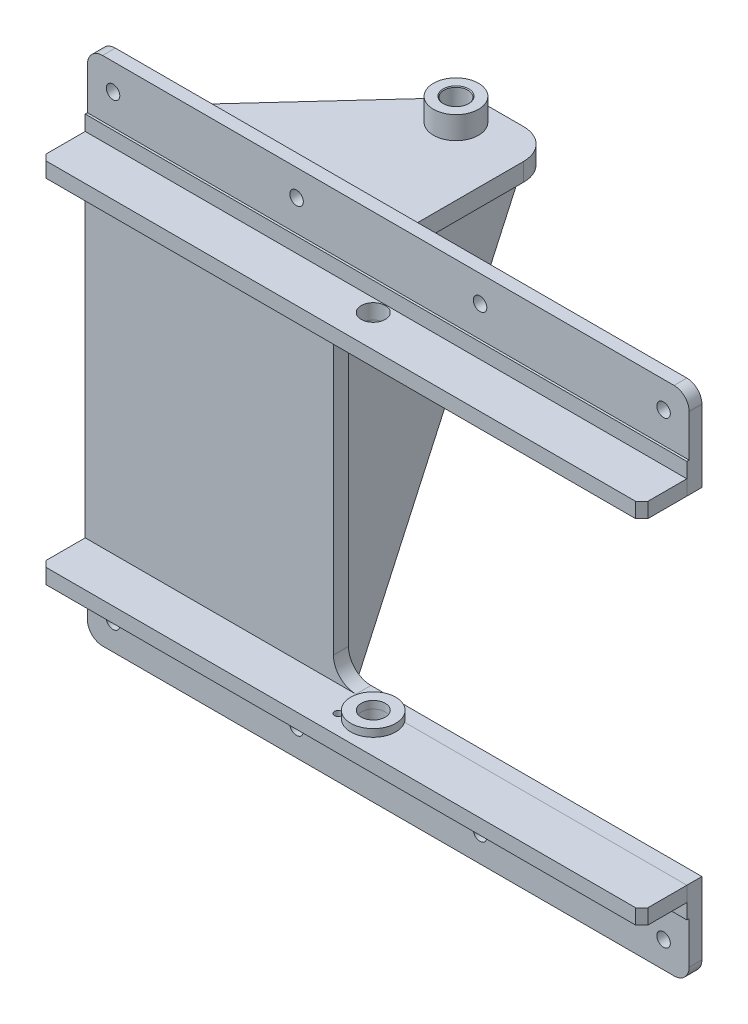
ISO-10303-21;
HEADER;
FILE_DESCRIPTION(('STEP AP214'),'2;1');
FILE_NAME('part.step','',(''),(''),'','','');
FILE_SCHEMA(('AUTOMOTIVE_DESIGN { 1 0 10303 214 1 1 1 1 }'));
ENDSEC;
DATA;
#1=APPLICATION_CONTEXT('core data for automotive mechanical design processes');
#2=APPLICATION_PROTOCOL_DEFINITION('international standard','automotive_design',2000,#1);
#3=PRODUCT_CONTEXT('',#1,'mechanical');
#4=PRODUCT('Part','Part','',(#3));
#5=PRODUCT_RELATED_PRODUCT_CATEGORY('part','',(#4));
#6=PRODUCT_DEFINITION_FORMATION('','',#4);
#7=PRODUCT_DEFINITION_CONTEXT('part definition',#1,'design');
#8=PRODUCT_DEFINITION('design','',#6,#7);
#9=PRODUCT_DEFINITION_SHAPE('','',#8);
#10=(LENGTH_UNIT() NAMED_UNIT(*) SI_UNIT(.MILLI.,.METRE.));
#11=(NAMED_UNIT(*) PLANE_ANGLE_UNIT() SI_UNIT($,.RADIAN.));
#12=(NAMED_UNIT(*) SI_UNIT($,.STERADIAN.) SOLID_ANGLE_UNIT());
#13=UNCERTAINTY_MEASURE_WITH_UNIT(LENGTH_MEASURE(1.E-05),#10,'distance_accuracy_value','');
#14=(GEOMETRIC_REPRESENTATION_CONTEXT(3) GLOBAL_UNCERTAINTY_ASSIGNED_CONTEXT((#13)) GLOBAL_UNIT_ASSIGNED_CONTEXT((#10,
#11,#12)) REPRESENTATION_CONTEXT('',''));
#15=CARTESIAN_POINT('',(0.,0.,0.));
#16=DIRECTION('',(0.,0.,1.));
#17=DIRECTION('',(1.,0.,0.));
#18=AXIS2_PLACEMENT_3D('',#15,#16,#17);
#19=CARTESIAN_POINT('',(-80.,139.,-126.5));
#20=DIRECTION('',(0.,1.,0.));
#21=DIRECTION('',(0.,0.,1.));
#22=AXIS2_PLACEMENT_3D('',#19,#20,#21);
#23=CONICAL_SURFACE('',#22,8.49999999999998,0.785398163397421);
#24=CARTESIAN_POINT('',(-80.,138.5,-126.5));
#25=DIRECTION('',(0.,1.,0.));
#26=DIRECTION('',(-1.,0.,0.));
#27=AXIS2_PLACEMENT_3D('',#24,#25,#26);
#28=CIRCLE('',#27,8.00000000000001);
#29=CARTESIAN_POINT('',(-88.,138.5,-126.5));
#30=VERTEX_POINT('',#29);
#31=EDGE_CURVE('P0_E29',#30,#30,#28,.F.);
#32=ORIENTED_EDGE('',*,*,#31,.T.);
#33=EDGE_LOOP('',(#32));
#34=FACE_BOUND('',#33,.T.);
#35=CARTESIAN_POINT('',(-80.,139.,-126.5));
#36=DIRECTION('',(0.,1.,0.));
#37=DIRECTION('',(0.,0.,1.));
#38=AXIS2_PLACEMENT_3D('',#35,#36,#37);
#39=CIRCLE('',#38,8.49999999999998);
#40=CARTESIAN_POINT('',(-80.,139.,-118.));
#41=VERTEX_POINT('',#40);
#42=EDGE_CURVE('P0_E17',#41,#41,#39,.F.);
#43=ORIENTED_EDGE('',*,*,#42,.F.);
#44=EDGE_LOOP('',(#43));
#45=FACE_BOUND('',#44,.T.);
#46=ADVANCED_FACE('P0_F14',(#34,#45),#23,.F.);
#47=CARTESIAN_POINT('',(-80.,-170.,-126.5));
#48=DIRECTION('',(0.,1.,0.));
#49=DIRECTION('',(-1.,0.,0.));
#50=AXIS2_PLACEMENT_3D('',#47,#48,#49);
#51=CYLINDRICAL_SURFACE('',#50,8.00000000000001);
#52=CARTESIAN_POINT('',(-80.,124.,-126.5));
#53=DIRECTION('',(0.,1.,0.));
#54=DIRECTION('',(-1.,0.,0.));
#55=AXIS2_PLACEMENT_3D('',#52,#53,#54);
#56=CIRCLE('',#55,8.00000000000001);
#57=CARTESIAN_POINT('',(-88.,124.,-126.5));
#58=VERTEX_POINT('',#57);
#59=EDGE_CURVE('P0_E26',#58,#58,#56,.F.);
#60=ORIENTED_EDGE('',*,*,#59,.T.);
#61=EDGE_LOOP('',(#60));
#62=FACE_BOUND('',#61,.T.);
#63=ORIENTED_EDGE('',*,*,#31,.F.);
#64=EDGE_LOOP('',(#63));
#65=FACE_BOUND('',#64,.T.);
#66=ADVANCED_FACE('P0_F41',(#62,#65),#51,.F.);
#67=CARTESIAN_POINT('',(-80.,139.,-126.5));
#68=DIRECTION('',(0.,1.,0.));
#69=DIRECTION('',(-1.,0.,0.));
#70=AXIS2_PLACEMENT_3D('',#67,#68,#69);
#71=PLANE('',#70);
#72=CARTESIAN_POINT('',(-80.,139.,-126.5));
#73=DIRECTION('',(0.,-1.,0.));
#74=DIRECTION('',(1.,0.,0.));
#75=AXIS2_PLACEMENT_3D('',#72,#73,#74);
#76=CIRCLE('',#75,15.);
#77=CARTESIAN_POINT('',(-65.,139.,-126.5));
#78=VERTEX_POINT('',#77);
#79=EDGE_CURVE('P0_E21',#78,#78,#76,.T.);
#80=ORIENTED_EDGE('',*,*,#79,.F.);
#81=EDGE_LOOP('',(#80));
#82=FACE_BOUND('',#81,.T.);
#83=ORIENTED_EDGE('',*,*,#42,.T.);
#84=EDGE_LOOP('',(#83));
#85=FACE_BOUND('',#84,.T.);
#86=ADVANCED_FACE('P0_F43',(#82,#85),#71,.T.);
#87=CARTESIAN_POINT('',(-80.,124.,-126.5));
#88=DIRECTION('',(0.,1.,0.));
#89=DIRECTION('',(-1.,0.,0.));
#90=AXIS2_PLACEMENT_3D('',#87,#88,#89);
#91=PLANE('',#90);
#92=CARTESIAN_POINT('',(-80.,124.,-126.5));
#93=DIRECTION('',(0.,-1.,0.));
#94=DIRECTION('',(1.,0.,0.));
#95=AXIS2_PLACEMENT_3D('',#92,#93,#94);
#96=CIRCLE('',#95,15.);
#97=CARTESIAN_POINT('',(-65.,124.,-126.5));
#98=VERTEX_POINT('',#97);
#99=EDGE_CURVE('P0_E10',#98,#98,#96,.F.);
#100=ORIENTED_EDGE('',*,*,#99,.F.);
#101=EDGE_LOOP('',(#100));
#102=FACE_BOUND('',#101,.T.);
#103=ORIENTED_EDGE('',*,*,#59,.F.);
#104=EDGE_LOOP('',(#103));
#105=FACE_BOUND('',#104,.T.);
#106=ADVANCED_FACE('P0_F49',(#102,#105),#91,.F.);
#107=CARTESIAN_POINT('',(-80.,139.,-126.5));
#108=DIRECTION('',(0.,-1.,0.));
#109=DIRECTION('',(1.,0.,0.));
#110=AXIS2_PLACEMENT_3D('',#107,#108,#109);
#111=CYLINDRICAL_SURFACE('',#110,15.);
#112=ORIENTED_EDGE('',*,*,#79,.T.);
#113=EDGE_LOOP('',(#112));
#114=FACE_BOUND('',#113,.T.);
#115=ORIENTED_EDGE('',*,*,#99,.T.);
#116=EDGE_LOOP('',(#115));
#117=FACE_BOUND('',#116,.T.);
#118=ADVANCED_FACE('P0_F53',(#114,#117),#111,.T.);
#119=CLOSED_SHELL('',(#46,#66,#86,#106,#118));
#120=MANIFOLD_SOLID_BREP('P0_B1',#119);
#121=CARTESIAN_POINT('',(-200.,-132.,-1.5));
#122=DIRECTION('',(0.,1.,0.));
#123=DIRECTION('',(0.,0.,1.));
#124=AXIS2_PLACEMENT_3D('',#121,#122,#123);
#125=PLANE('',#124);
#126=DIRECTION('',(0.,0.,1.));
#127=VECTOR('',#126,1.);
#128=CARTESIAN_POINT('',(-200.,-132.,-1.5));
#129=LINE('',#128,#127);
#130=CARTESIAN_POINT('',(-200.,-132.,-1.5));
#131=VERTEX_POINT('',#130);
#132=CARTESIAN_POINT('',(-200.,-132.,0.));
#133=VERTEX_POINT('',#132);
#134=EDGE_CURVE('P1_E239',#131,#133,#129,.T.);
#135=ORIENTED_EDGE('',*,*,#134,.F.);
#136=DIRECTION('',(1.,0.,0.));
#137=VECTOR('',#136,1.);
#138=CARTESIAN_POINT('',(200.,-132.,-1.5));
#139=LINE('',#138,#137);
#140=CARTESIAN_POINT('',(200.,-132.,-1.5));
#141=VERTEX_POINT('',#140);
#142=EDGE_CURVE('P1_E159',#141,#131,#139,.F.);
#143=ORIENTED_EDGE('',*,*,#142,.F.);
#144=DIRECTION('',(0.,0.,1.));
#145=VECTOR('',#144,1.);
#146=CARTESIAN_POINT('',(200.,-132.,-1.5));
#147=LINE('',#146,#145);
#148=CARTESIAN_POINT('',(200.,-132.,0.));
#149=VERTEX_POINT('',#148);
#150=EDGE_CURVE('P1_E133',#149,#141,#147,.F.);
#151=ORIENTED_EDGE('',*,*,#150,.F.);
#152=DIRECTION('',(1.,0.,0.));
#153=VECTOR('',#152,1.);
#154=CARTESIAN_POINT('',(-20.,-132.,0.));
#155=LINE('',#154,#153);
#156=EDGE_CURVE('P1_E192',#133,#149,#155,.T.);
#157=ORIENTED_EDGE('',*,*,#156,.F.);
#158=EDGE_LOOP('',(#135,#143,#151,#157));
#159=FACE_BOUND('',#158,.T.);
#160=ADVANCED_FACE('P1_F16',(#159),#125,.F.);
#161=CARTESIAN_POINT('',(-200.,132.,-1.5));
#162=DIRECTION('',(0.,-1.,0.));
#163=DIRECTION('',(0.,0.,-1.));
#164=AXIS2_PLACEMENT_3D('',#161,#162,#163);
#165=PLANE('',#164);
#166=DIRECTION('',(0.,0.,-1.));
#167=VECTOR('',#166,1.);
#168=CARTESIAN_POINT('',(200.,132.,-1.5));
#169=LINE('',#168,#167);
#170=CARTESIAN_POINT('',(200.,132.,-1.5));
#171=VERTEX_POINT('',#170);
#172=CARTESIAN_POINT('',(200.,132.,0.));
#173=VERTEX_POINT('',#172);
#174=EDGE_CURVE('P1_E150',#171,#173,#169,.F.);
#175=ORIENTED_EDGE('',*,*,#174,.F.);
#176=DIRECTION('',(1.,0.,0.));
#177=VECTOR('',#176,1.);
#178=CARTESIAN_POINT('',(-200.,132.,-1.5));
#179=LINE('',#178,#177);
#180=CARTESIAN_POINT('',(-200.,132.,-1.5));
#181=VERTEX_POINT('',#180);
#182=EDGE_CURVE('P1_E155',#181,#171,#179,.T.);
#183=ORIENTED_EDGE('',*,*,#182,.F.);
#184=DIRECTION('',(0.,0.,-1.));
#185=VECTOR('',#184,1.);
#186=CARTESIAN_POINT('',(-200.,132.,-1.5));
#187=LINE('',#186,#185);
#188=CARTESIAN_POINT('',(-200.,132.,0.));
#189=VERTEX_POINT('',#188);
#190=EDGE_CURVE('P1_E116',#189,#181,#187,.T.);
#191=ORIENTED_EDGE('',*,*,#190,.F.);
#192=DIRECTION('',(1.,0.,0.));
#193=VECTOR('',#192,1.);
#194=CARTESIAN_POINT('',(-20.,132.,0.));
#195=LINE('',#194,#193);
#196=EDGE_CURVE('P1_E157',#173,#189,#195,.F.);
#197=ORIENTED_EDGE('',*,*,#196,.F.);
#198=EDGE_LOOP('',(#175,#183,#191,#197));
#199=FACE_BOUND('',#198,.T.);
#200=ADVANCED_FACE('P1_F154',(#199),#165,.F.);
#201=CARTESIAN_POINT('',(200.,-170.,-1.5));
#202=DIRECTION('',(0.,0.,1.));
#203=DIRECTION('',(1.,0.,0.));
#204=AXIS2_PLACEMENT_3D('',#201,#202,#203);
#205=PLANE('',#204);
#206=DIRECTION('',(0.,1.,0.));
#207=VECTOR('',#206,1.);
#208=CARTESIAN_POINT('',(-200.,170.,-1.5));
#209=LINE('',#208,#207);
#210=CARTESIAN_POINT('',(-200.,-160.,-1.5));
#211=VERTEX_POINT('',#210);
#212=EDGE_CURVE('P1_E227',#211,#131,#209,.T.);
#213=ORIENTED_EDGE('',*,*,#212,.F.);
#214=CARTESIAN_POINT('',(-190.,-160.,-1.5));
#215=DIRECTION('',(0.,0.,1.));
#216=DIRECTION('',(1.,0.,0.));
#217=AXIS2_PLACEMENT_3D('',#214,#215,#216);
#218=CIRCLE('',#217,10.);
#219=CARTESIAN_POINT('',(-190.,-170.,-1.5));
#220=VERTEX_POINT('',#219);
#221=EDGE_CURVE('P1_E312',#220,#211,#218,.F.);
#222=ORIENTED_EDGE('',*,*,#221,.F.);
#223=DIRECTION('',(1.,0.,0.));
#224=VECTOR('',#223,1.);
#225=CARTESIAN_POINT('',(-200.,-170.,-1.5));
#226=LINE('',#225,#224);
#227=CARTESIAN_POINT('',(190.,-170.,-1.5));
#228=VERTEX_POINT('',#227);
#229=EDGE_CURVE('P1_E223',#228,#220,#226,.F.);
#230=ORIENTED_EDGE('',*,*,#229,.F.);
#231=CARTESIAN_POINT('',(190.,-160.,-1.5));
#232=DIRECTION('',(0.,0.,1.));
#233=DIRECTION('',(1.,0.,0.));
#234=AXIS2_PLACEMENT_3D('',#231,#232,#233);
#235=CIRCLE('',#234,10.);
#236=CARTESIAN_POINT('',(200.,-160.,-1.5));
#237=VERTEX_POINT('',#236);
#238=EDGE_CURVE('P1_E310',#237,#228,#235,.F.);
#239=ORIENTED_EDGE('',*,*,#238,.F.);
#240=DIRECTION('',(0.,1.,0.));
#241=VECTOR('',#240,1.);
#242=CARTESIAN_POINT('',(200.,-112.,-1.5));
#243=LINE('',#242,#241);
#244=EDGE_CURVE('P1_E214',#141,#237,#243,.F.);
#245=ORIENTED_EDGE('',*,*,#244,.F.);
#246=ORIENTED_EDGE('',*,*,#142,.T.);
#247=EDGE_LOOP('',(#213,#222,#230,#239,#245,#246));
#248=FACE_BOUND('',#247,.T.);
#249=CARTESIAN_POINT('',(-61.,-152.5,-1.5));
#250=DIRECTION('',(0.,0.,1.));
#251=DIRECTION('',(1.,0.,0.));
#252=AXIS2_PLACEMENT_3D('',#249,#250,#251);
#253=CIRCLE('',#252,4.5);
#254=CARTESIAN_POINT('',(-56.5,-152.5,-1.5));
#255=VERTEX_POINT('',#254);
#256=EDGE_CURVE('P1_E322',#255,#255,#253,.F.);
#257=ORIENTED_EDGE('',*,*,#256,.T.);
#258=EDGE_LOOP('',(#257));
#259=FACE_BOUND('',#258,.T.);
#260=CARTESIAN_POINT('',(-183.,-152.5,-1.5));
#261=DIRECTION('',(0.,0.,1.));
#262=DIRECTION('',(1.,0.,0.));
#263=AXIS2_PLACEMENT_3D('',#260,#261,#262);
#264=CIRCLE('',#263,4.5);
#265=CARTESIAN_POINT('',(-178.5,-152.5,-1.5));
#266=VERTEX_POINT('',#265);
#267=EDGE_CURVE('P1_E325',#266,#266,#264,.F.);
#268=ORIENTED_EDGE('',*,*,#267,.T.);
#269=EDGE_LOOP('',(#268));
#270=FACE_BOUND('',#269,.T.);
#271=CARTESIAN_POINT('',(183.,-152.5,-1.5));
#272=DIRECTION('',(0.,0.,1.));
#273=DIRECTION('',(1.,0.,0.));
#274=AXIS2_PLACEMENT_3D('',#271,#272,#273);
#275=CIRCLE('',#274,4.5);
#276=CARTESIAN_POINT('',(187.5,-152.5,-1.5));
#277=VERTEX_POINT('',#276);
#278=EDGE_CURVE('P1_E328',#277,#277,#275,.F.);
#279=ORIENTED_EDGE('',*,*,#278,.T.);
#280=EDGE_LOOP('',(#279));
#281=FACE_BOUND('',#280,.T.);
#282=CARTESIAN_POINT('',(61.,-152.5,-1.5));
#283=DIRECTION('',(0.,0.,1.));
#284=DIRECTION('',(1.,0.,0.));
#285=AXIS2_PLACEMENT_3D('',#282,#283,#284);
#286=CIRCLE('',#285,4.5);
#287=CARTESIAN_POINT('',(65.5,-152.5,-1.5));
#288=VERTEX_POINT('',#287);
#289=EDGE_CURVE('P1_E331',#288,#288,#286,.F.);
#290=ORIENTED_EDGE('',*,*,#289,.T.);
#291=EDGE_LOOP('',(#290));
#292=FACE_BOUND('',#291,.T.);
#293=ADVANCED_FACE('P1_F444',(#248,#259,#270,#281,#292),#205,.T.);
#294=CARTESIAN_POINT('',(-20.,-97.,0.));
#295=DIRECTION('',(0.,0.,1.));
#296=DIRECTION('',(1.,0.,0.));
#297=AXIS2_PLACEMENT_3D('',#294,#295,#296);
#298=PLANE('',#297);
#299=ORIENTED_EDGE('',*,*,#196,.T.);
#300=DIRECTION('',(0.,1.,0.));
#301=VECTOR('',#300,1.);
#302=CARTESIAN_POINT('',(-200.,170.,0.));
#303=LINE('',#302,#301);
#304=EDGE_CURVE('P1_E230',#133,#189,#303,.T.);
#305=ORIENTED_EDGE('',*,*,#304,.F.);
#306=ORIENTED_EDGE('',*,*,#156,.T.);
#307=DIRECTION('',(0.,1.,0.));
#308=VECTOR('',#307,1.);
#309=CARTESIAN_POINT('',(200.,-112.,0.));
#310=LINE('',#309,#308);
#311=CARTESIAN_POINT('',(200.,-112.,0.));
#312=VERTEX_POINT('',#311);
#313=EDGE_CURVE('P1_E203',#312,#149,#310,.F.);
#314=ORIENTED_EDGE('',*,*,#313,.F.);
#315=DIRECTION('',(-1.,0.,0.));
#316=VECTOR('',#315,1.);
#317=CARTESIAN_POINT('',(-19.9999999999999,-112.,0.));
#318=LINE('',#317,#316);
#319=CARTESIAN_POINT('',(-19.9999999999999,-112.,0.));
#320=VERTEX_POINT('',#319);
#321=EDGE_CURVE('P1_E140',#320,#312,#318,.F.);
#322=ORIENTED_EDGE('',*,*,#321,.F.);
#323=CARTESIAN_POINT('',(-20.,-97.,0.));
#324=DIRECTION('',(0.,0.,1.));
#325=DIRECTION('',(1.,0.,0.));
#326=AXIS2_PLACEMENT_3D('',#323,#324,#325);
#327=CIRCLE('',#326,15.);
#328=CARTESIAN_POINT('',(-35.,-96.9999999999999,0.));
#329=VERTEX_POINT('',#328);
#330=EDGE_CURVE('P1_E200',#320,#329,#327,.F.);
#331=ORIENTED_EDGE('',*,*,#330,.T.);
#332=DIRECTION('',(0.,1.,0.));
#333=VECTOR('',#332,1.);
#334=CARTESIAN_POINT('',(-35.,96.9999999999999,0.));
#335=LINE('',#334,#333);
#336=CARTESIAN_POINT('',(-35.,96.9999999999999,0.));
#337=VERTEX_POINT('',#336);
#338=EDGE_CURVE('P1_E197',#337,#329,#335,.F.);
#339=ORIENTED_EDGE('',*,*,#338,.F.);
#340=CARTESIAN_POINT('',(-20.,97.,0.));
#341=DIRECTION('',(0.,0.,1.));
#342=DIRECTION('',(1.,0.,0.));
#343=AXIS2_PLACEMENT_3D('',#340,#341,#342);
#344=CIRCLE('',#343,15.);
#345=CARTESIAN_POINT('',(-19.9999999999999,112.,0.));
#346=VERTEX_POINT('',#345);
#347=EDGE_CURVE('P1_E186',#337,#346,#344,.F.);
#348=ORIENTED_EDGE('',*,*,#347,.T.);
#349=DIRECTION('',(1.,0.,0.));
#350=VECTOR('',#349,1.);
#351=CARTESIAN_POINT('',(200.,112.,0.));
#352=LINE('',#351,#350);
#353=CARTESIAN_POINT('',(200.,112.,0.));
#354=VERTEX_POINT('',#353);
#355=EDGE_CURVE('P1_E177',#354,#346,#352,.F.);
#356=ORIENTED_EDGE('',*,*,#355,.F.);
#357=DIRECTION('',(0.,1.,0.));
#358=VECTOR('',#357,1.);
#359=CARTESIAN_POINT('',(200.,170.,0.));
#360=LINE('',#359,#358);
#361=EDGE_CURVE('P1_E172',#173,#354,#360,.F.);
#362=ORIENTED_EDGE('',*,*,#361,.F.);
#363=EDGE_LOOP('',(#299,#305,#306,#314,#322,#331,#339,#348,#356,#362));
#364=FACE_BOUND('',#363,.T.);
#365=ADVANCED_FACE('P1_F354',(#364),#298,.T.);
#366=CARTESIAN_POINT('',(-200.,132.,-1.5));
#367=DIRECTION('',(0.,0.,1.));
#368=DIRECTION('',(1.,0.,0.));
#369=AXIS2_PLACEMENT_3D('',#366,#367,#368);
#370=PLANE('',#369);
#371=DIRECTION('',(0.,1.,0.));
#372=VECTOR('',#371,1.);
#373=CARTESIAN_POINT('',(-200.,170.,-1.5));
#374=LINE('',#373,#372);
#375=CARTESIAN_POINT('',(-200.,160.,-1.5));
#376=VERTEX_POINT('',#375);
#377=EDGE_CURVE('P1_E110',#181,#376,#374,.T.);
#378=ORIENTED_EDGE('',*,*,#377,.F.);
#379=ORIENTED_EDGE('',*,*,#182,.T.);
#380=DIRECTION('',(0.,1.,0.));
#381=VECTOR('',#380,1.);
#382=CARTESIAN_POINT('',(200.,170.,-1.5));
#383=LINE('',#382,#381);
#384=CARTESIAN_POINT('',(200.,160.,-1.5));
#385=VERTEX_POINT('',#384);
#386=EDGE_CURVE('P1_E166',#385,#171,#383,.F.);
#387=ORIENTED_EDGE('',*,*,#386,.F.);
#388=CARTESIAN_POINT('',(190.,160.,-1.5));
#389=DIRECTION('',(0.,0.,1.));
#390=DIRECTION('',(1.,0.,0.));
#391=AXIS2_PLACEMENT_3D('',#388,#389,#390);
#392=CIRCLE('',#391,10.);
#393=CARTESIAN_POINT('',(190.,170.,-1.5));
#394=VERTEX_POINT('',#393);
#395=EDGE_CURVE('P1_E302',#394,#385,#392,.F.);
#396=ORIENTED_EDGE('',*,*,#395,.F.);
#397=DIRECTION('',(1.,0.,0.));
#398=VECTOR('',#397,1.);
#399=CARTESIAN_POINT('',(-200.,170.,-1.5));
#400=LINE('',#399,#398);
#401=CARTESIAN_POINT('',(-190.,170.,-1.5));
#402=VERTEX_POINT('',#401);
#403=EDGE_CURVE('P1_E181',#402,#394,#400,.T.);
#404=ORIENTED_EDGE('',*,*,#403,.F.);
#405=CARTESIAN_POINT('',(-190.,160.,-1.5));
#406=DIRECTION('',(0.,0.,1.));
#407=DIRECTION('',(1.,0.,0.));
#408=AXIS2_PLACEMENT_3D('',#405,#406,#407);
#409=CIRCLE('',#408,10.);
#410=EDGE_CURVE('P1_E231',#376,#402,#409,.F.);
#411=ORIENTED_EDGE('',*,*,#410,.F.);
#412=EDGE_LOOP('',(#378,#379,#387,#396,#404,#411));
#413=FACE_BOUND('',#412,.T.);
#414=CARTESIAN_POINT('',(-183.,152.5,-1.5));
#415=DIRECTION('',(0.,0.,1.));
#416=DIRECTION('',(1.,0.,0.));
#417=AXIS2_PLACEMENT_3D('',#414,#415,#416);
#418=CIRCLE('',#417,4.5);
#419=CARTESIAN_POINT('',(-178.5,152.5,-1.5));
#420=VERTEX_POINT('',#419);
#421=EDGE_CURVE('P1_E316',#420,#420,#418,.F.);
#422=ORIENTED_EDGE('',*,*,#421,.T.);
#423=EDGE_LOOP('',(#422));
#424=FACE_BOUND('',#423,.T.);
#425=CARTESIAN_POINT('',(-61.,152.5,-1.5));
#426=DIRECTION('',(0.,0.,1.));
#427=DIRECTION('',(1.,0.,0.));
#428=AXIS2_PLACEMENT_3D('',#425,#426,#427);
#429=CIRCLE('',#428,4.5);
#430=CARTESIAN_POINT('',(-56.5,152.5,-1.5));
#431=VERTEX_POINT('',#430);
#432=EDGE_CURVE('P1_E319',#431,#431,#429,.F.);
#433=ORIENTED_EDGE('',*,*,#432,.T.);
#434=EDGE_LOOP('',(#433));
#435=FACE_BOUND('',#434,.T.);
#436=CARTESIAN_POINT('',(61.,152.5,-1.5));
#437=DIRECTION('',(0.,0.,1.));
#438=DIRECTION('',(1.,0.,0.));
#439=AXIS2_PLACEMENT_3D('',#436,#437,#438);
#440=CIRCLE('',#439,4.5);
#441=CARTESIAN_POINT('',(65.5,152.5,-1.5));
#442=VERTEX_POINT('',#441);
#443=EDGE_CURVE('P1_E333',#442,#442,#440,.F.);
#444=ORIENTED_EDGE('',*,*,#443,.T.);
#445=EDGE_LOOP('',(#444));
#446=FACE_BOUND('',#445,.T.);
#447=CARTESIAN_POINT('',(183.,152.5,-1.5));
#448=DIRECTION('',(0.,0.,1.));
#449=DIRECTION('',(1.,0.,0.));
#450=AXIS2_PLACEMENT_3D('',#447,#448,#449);
#451=CIRCLE('',#450,4.5);
#452=CARTESIAN_POINT('',(187.5,152.5,-1.5));
#453=VERTEX_POINT('',#452);
#454=EDGE_CURVE('P1_E19',#453,#453,#451,.F.);
#455=ORIENTED_EDGE('',*,*,#454,.T.);
#456=EDGE_LOOP('',(#455));
#457=FACE_BOUND('',#456,.T.);
#458=ADVANCED_FACE('P1_F163',(#413,#424,#435,#446,#457),#370,.T.);
#459=CARTESIAN_POINT('',(183.,152.5,-146.5));
#460=DIRECTION('',(0.,0.,1.));
#461=DIRECTION('',(1.,0.,0.));
#462=AXIS2_PLACEMENT_3D('',#459,#460,#461);
#463=CYLINDRICAL_SURFACE('',#462,4.5);
#464=CARTESIAN_POINT('',(183.,152.5,-10.));
#465=DIRECTION('',(0.,0.,1.));
#466=DIRECTION('',(1.,0.,0.));
#467=AXIS2_PLACEMENT_3D('',#464,#465,#466);
#468=CIRCLE('',#467,4.5);
#469=CARTESIAN_POINT('',(187.5,152.5,-10.));
#470=VERTEX_POINT('',#469);
#471=EDGE_CURVE('P1_E298',#470,#470,#468,.F.);
#472=ORIENTED_EDGE('',*,*,#471,.T.);
#473=EDGE_LOOP('',(#472));
#474=FACE_BOUND('',#473,.T.);
#475=ORIENTED_EDGE('',*,*,#454,.F.);
#476=EDGE_LOOP('',(#475));
#477=FACE_BOUND('',#476,.T.);
#478=ADVANCED_FACE('P1_F341',(#474,#477),#463,.F.);
#479=CARTESIAN_POINT('',(61.,152.5,-146.5));
#480=DIRECTION('',(0.,0.,1.));
#481=DIRECTION('',(1.,0.,0.));
#482=AXIS2_PLACEMENT_3D('',#479,#480,#481);
#483=CYLINDRICAL_SURFACE('',#482,4.5);
#484=CARTESIAN_POINT('',(61.,152.5,-10.));
#485=DIRECTION('',(0.,0.,1.));
#486=DIRECTION('',(1.,0.,0.));
#487=AXIS2_PLACEMENT_3D('',#484,#485,#486);
#488=CIRCLE('',#487,4.5);
#489=CARTESIAN_POINT('',(65.5,152.5,-10.));
#490=VERTEX_POINT('',#489);
#491=EDGE_CURVE('P1_E295',#490,#490,#488,.F.);
#492=ORIENTED_EDGE('',*,*,#491,.T.);
#493=EDGE_LOOP('',(#492));
#494=FACE_BOUND('',#493,.T.);
#495=ORIENTED_EDGE('',*,*,#443,.F.);
#496=EDGE_LOOP('',(#495));
#497=FACE_BOUND('',#496,.T.);
#498=ADVANCED_FACE('P1_F343',(#494,#497),#483,.F.);
#499=CARTESIAN_POINT('',(61.,-152.5,-146.5));
#500=DIRECTION('',(0.,0.,1.));
#501=DIRECTION('',(1.,0.,0.));
#502=AXIS2_PLACEMENT_3D('',#499,#500,#501);
#503=CYLINDRICAL_SURFACE('',#502,4.5);
#504=CARTESIAN_POINT('',(61.,-152.5,-10.));
#505=DIRECTION('',(0.,0.,1.));
#506=DIRECTION('',(1.,0.,0.));
#507=AXIS2_PLACEMENT_3D('',#504,#505,#506);
#508=CIRCLE('',#507,4.5);
#509=CARTESIAN_POINT('',(65.5,-152.5,-10.));
#510=VERTEX_POINT('',#509);
#511=EDGE_CURVE('P1_E292',#510,#510,#508,.F.);
#512=ORIENTED_EDGE('',*,*,#511,.T.);
#513=EDGE_LOOP('',(#512));
#514=FACE_BOUND('',#513,.T.);
#515=ORIENTED_EDGE('',*,*,#289,.F.);
#516=EDGE_LOOP('',(#515));
#517=FACE_BOUND('',#516,.T.);
#518=ADVANCED_FACE('P1_F351',(#514,#517),#503,.F.);
#519=CARTESIAN_POINT('',(183.,-152.5,-146.5));
#520=DIRECTION('',(0.,0.,1.));
#521=DIRECTION('',(1.,0.,0.));
#522=AXIS2_PLACEMENT_3D('',#519,#520,#521);
#523=CYLINDRICAL_SURFACE('',#522,4.5);
#524=CARTESIAN_POINT('',(183.,-152.5,-10.));
#525=DIRECTION('',(0.,0.,1.));
#526=DIRECTION('',(1.,0.,0.));
#527=AXIS2_PLACEMENT_3D('',#524,#525,#526);
#528=CIRCLE('',#527,4.5);
#529=CARTESIAN_POINT('',(187.5,-152.5,-10.));
#530=VERTEX_POINT('',#529);
#531=EDGE_CURVE('P1_E289',#530,#530,#528,.F.);
#532=ORIENTED_EDGE('',*,*,#531,.T.);
#533=EDGE_LOOP('',(#532));
#534=FACE_BOUND('',#533,.T.);
#535=ORIENTED_EDGE('',*,*,#278,.F.);
#536=EDGE_LOOP('',(#535));
#537=FACE_BOUND('',#536,.T.);
#538=ADVANCED_FACE('P1_F431',(#534,#537),#523,.F.);
#539=CARTESIAN_POINT('',(-183.,-152.5,-146.5));
#540=DIRECTION('',(0.,0.,1.));
#541=DIRECTION('',(1.,0.,0.));
#542=AXIS2_PLACEMENT_3D('',#539,#540,#541);
#543=CYLINDRICAL_SURFACE('',#542,4.5);
#544=CARTESIAN_POINT('',(-183.,-152.5,-10.));
#545=DIRECTION('',(0.,0.,1.));
#546=DIRECTION('',(1.,0.,0.));
#547=AXIS2_PLACEMENT_3D('',#544,#545,#546);
#548=CIRCLE('',#547,4.5);
#549=CARTESIAN_POINT('',(-178.5,-152.5,-10.));
#550=VERTEX_POINT('',#549);
#551=EDGE_CURVE('P1_E286',#550,#550,#548,.F.);
#552=ORIENTED_EDGE('',*,*,#551,.T.);
#553=EDGE_LOOP('',(#552));
#554=FACE_BOUND('',#553,.T.);
#555=ORIENTED_EDGE('',*,*,#267,.F.);
#556=EDGE_LOOP('',(#555));
#557=FACE_BOUND('',#556,.T.);
#558=ADVANCED_FACE('P1_F427',(#554,#557),#543,.F.);
#559=CARTESIAN_POINT('',(-61.,-152.5,-146.5));
#560=DIRECTION('',(0.,0.,1.));
#561=DIRECTION('',(1.,0.,0.));
#562=AXIS2_PLACEMENT_3D('',#559,#560,#561);
#563=CYLINDRICAL_SURFACE('',#562,4.5);
#564=CARTESIAN_POINT('',(-61.,-152.5,-10.));
#565=DIRECTION('',(0.,0.,1.));
#566=DIRECTION('',(1.,0.,0.));
#567=AXIS2_PLACEMENT_3D('',#564,#565,#566);
#568=CIRCLE('',#567,4.5);
#569=CARTESIAN_POINT('',(-56.5,-152.5,-10.));
#570=VERTEX_POINT('',#569);
#571=EDGE_CURVE('P1_E283',#570,#570,#568,.F.);
#572=ORIENTED_EDGE('',*,*,#571,.T.);
#573=EDGE_LOOP('',(#572));
#574=FACE_BOUND('',#573,.T.);
#575=ORIENTED_EDGE('',*,*,#256,.F.);
#576=EDGE_LOOP('',(#575));
#577=FACE_BOUND('',#576,.T.);
#578=ADVANCED_FACE('P1_F423',(#574,#577),#563,.F.);
#579=CARTESIAN_POINT('',(-61.,152.5,-146.5));
#580=DIRECTION('',(0.,0.,1.));
#581=DIRECTION('',(1.,0.,0.));
#582=AXIS2_PLACEMENT_3D('',#579,#580,#581);
#583=CYLINDRICAL_SURFACE('',#582,4.5);
#584=CARTESIAN_POINT('',(-61.,152.5,-10.));
#585=DIRECTION('',(0.,0.,1.));
#586=DIRECTION('',(1.,0.,0.));
#587=AXIS2_PLACEMENT_3D('',#584,#585,#586);
#588=CIRCLE('',#587,4.5);
#589=CARTESIAN_POINT('',(-56.5,152.5,-10.));
#590=VERTEX_POINT('',#589);
#591=EDGE_CURVE('P1_E280',#590,#590,#588,.F.);
#592=ORIENTED_EDGE('',*,*,#591,.T.);
#593=EDGE_LOOP('',(#592));
#594=FACE_BOUND('',#593,.T.);
#595=ORIENTED_EDGE('',*,*,#432,.F.);
#596=EDGE_LOOP('',(#595));
#597=FACE_BOUND('',#596,.T.);
#598=ADVANCED_FACE('P1_F419',(#594,#597),#583,.F.);
#599=CARTESIAN_POINT('',(-183.,152.5,-146.5));
#600=DIRECTION('',(0.,0.,1.));
#601=DIRECTION('',(1.,0.,0.));
#602=AXIS2_PLACEMENT_3D('',#599,#600,#601);
#603=CYLINDRICAL_SURFACE('',#602,4.5);
#604=CARTESIAN_POINT('',(-183.,152.5,-10.));
#605=DIRECTION('',(0.,0.,1.));
#606=DIRECTION('',(1.,0.,0.));
#607=AXIS2_PLACEMENT_3D('',#604,#605,#606);
#608=CIRCLE('',#607,4.5);
#609=CARTESIAN_POINT('',(-178.5,152.5,-10.));
#610=VERTEX_POINT('',#609);
#611=EDGE_CURVE('P1_E277',#610,#610,#608,.F.);
#612=ORIENTED_EDGE('',*,*,#611,.T.);
#613=EDGE_LOOP('',(#612));
#614=FACE_BOUND('',#613,.T.);
#615=ORIENTED_EDGE('',*,*,#421,.F.);
#616=EDGE_LOOP('',(#615));
#617=FACE_BOUND('',#616,.T.);
#618=ADVANCED_FACE('P1_F415',(#614,#617),#603,.F.);
#619=CARTESIAN_POINT('',(-190.,160.,-10.));
#620=DIRECTION('',(0.,0.,1.));
#621=DIRECTION('',(1.,0.,0.));
#622=AXIS2_PLACEMENT_3D('',#619,#620,#621);
#623=CYLINDRICAL_SURFACE('',#622,10.);
#624=ORIENTED_EDGE('',*,*,#410,.T.);
#625=DIRECTION('',(0.,0.,1.));
#626=VECTOR('',#625,1.);
#627=CARTESIAN_POINT('',(-190.,170.,-10.));
#628=LINE('',#627,#626);
#629=CARTESIAN_POINT('',(-190.,170.,-10.));
#630=VERTEX_POINT('',#629);
#631=EDGE_CURVE('P1_E301',#630,#402,#628,.T.);
#632=ORIENTED_EDGE('',*,*,#631,.F.);
#633=CARTESIAN_POINT('',(-190.,160.,-10.));
#634=DIRECTION('',(0.,0.,1.));
#635=DIRECTION('',(1.,0.,0.));
#636=AXIS2_PLACEMENT_3D('',#633,#634,#635);
#637=CIRCLE('',#636,10.);
#638=CARTESIAN_POINT('',(-200.,160.,-10.));
#639=VERTEX_POINT('',#638);
#640=EDGE_CURVE('P1_E274',#630,#639,#637,.T.);
#641=ORIENTED_EDGE('',*,*,#640,.T.);
#642=DIRECTION('',(0.,0.,1.));
#643=VECTOR('',#642,1.);
#644=CARTESIAN_POINT('',(-200.,160.,-10.));
#645=LINE('',#644,#643);
#646=EDGE_CURVE('P1_E235',#376,#639,#645,.F.);
#647=ORIENTED_EDGE('',*,*,#646,.F.);
#648=EDGE_LOOP('',(#624,#632,#641,#647));
#649=FACE_BOUND('',#648,.T.);
#650=ADVANCED_FACE('P1_F412',(#649),#623,.T.);
#651=CARTESIAN_POINT('',(-200.,170.,-10.));
#652=DIRECTION('',(-1.,0.,0.));
#653=DIRECTION('',(0.,0.,1.));
#654=AXIS2_PLACEMENT_3D('',#651,#652,#653);
#655=PLANE('',#654);
#656=ORIENTED_EDGE('',*,*,#377,.T.);
#657=ORIENTED_EDGE('',*,*,#646,.T.);
#658=DIRECTION('',(0.,1.,0.));
#659=VECTOR('',#658,1.);
#660=CARTESIAN_POINT('',(-200.,-97.,-10.));
#661=LINE('',#660,#659);
#662=CARTESIAN_POINT('',(-200.,-160.,-10.));
#663=VERTEX_POINT('',#662);
#664=EDGE_CURVE('P1_E273',#639,#663,#661,.F.);
#665=ORIENTED_EDGE('',*,*,#664,.T.);
#666=DIRECTION('',(0.,0.,1.));
#667=VECTOR('',#666,1.);
#668=CARTESIAN_POINT('',(-200.,-160.,-10.));
#669=LINE('',#668,#667);
#670=EDGE_CURVE('P1_E226',#211,#663,#669,.F.);
#671=ORIENTED_EDGE('',*,*,#670,.F.);
#672=ORIENTED_EDGE('',*,*,#212,.T.);
#673=ORIENTED_EDGE('',*,*,#134,.T.);
#674=ORIENTED_EDGE('',*,*,#304,.T.);
#675=ORIENTED_EDGE('',*,*,#190,.T.);
#676=EDGE_LOOP('',(#656,#657,#665,#671,#672,#673,#674,#675));
#677=FACE_BOUND('',#676,.T.);
#678=ADVANCED_FACE('P1_F408',(#677),#655,.T.);
#679=CARTESIAN_POINT('',(-190.,-160.,-10.));
#680=DIRECTION('',(0.,0.,1.));
#681=DIRECTION('',(1.,0.,0.));
#682=AXIS2_PLACEMENT_3D('',#679,#680,#681);
#683=CYLINDRICAL_SURFACE('',#682,10.);
#684=ORIENTED_EDGE('',*,*,#221,.T.);
#685=ORIENTED_EDGE('',*,*,#670,.T.);
#686=CARTESIAN_POINT('',(-190.,-160.,-10.));
#687=DIRECTION('',(0.,0.,1.));
#688=DIRECTION('',(1.,0.,0.));
#689=AXIS2_PLACEMENT_3D('',#686,#687,#688);
#690=CIRCLE('',#689,10.);
#691=CARTESIAN_POINT('',(-190.,-170.,-10.));
#692=VERTEX_POINT('',#691);
#693=EDGE_CURVE('P1_E270',#663,#692,#690,.T.);
#694=ORIENTED_EDGE('',*,*,#693,.T.);
#695=DIRECTION('',(0.,0.,-1.));
#696=VECTOR('',#695,1.);
#697=CARTESIAN_POINT('',(-190.,-170.,-10.));
#698=LINE('',#697,#696);
#699=EDGE_CURVE('P1_E225',#220,#692,#698,.T.);
#700=ORIENTED_EDGE('',*,*,#699,.F.);
#701=EDGE_LOOP('',(#684,#685,#694,#700));
#702=FACE_BOUND('',#701,.T.);
#703=ADVANCED_FACE('P1_F404',(#702),#683,.T.);
#704=CARTESIAN_POINT('',(-200.,-170.,-10.));
#705=DIRECTION('',(0.,-1.,0.));
#706=DIRECTION('',(0.,0.,-1.));
#707=AXIS2_PLACEMENT_3D('',#704,#705,#706);
#708=PLANE('',#707);
#709=ORIENTED_EDGE('',*,*,#229,.T.);
#710=ORIENTED_EDGE('',*,*,#699,.T.);
#711=DIRECTION('',(1.,0.,0.));
#712=VECTOR('',#711,1.);
#713=CARTESIAN_POINT('',(-20.,-170.,-10.));
#714=LINE('',#713,#712);
#715=CARTESIAN_POINT('',(190.,-170.,-10.));
#716=VERTEX_POINT('',#715);
#717=EDGE_CURVE('P1_E269',#692,#716,#714,.T.);
#718=ORIENTED_EDGE('',*,*,#717,.T.);
#719=DIRECTION('',(0.,0.,1.));
#720=VECTOR('',#719,1.);
#721=CARTESIAN_POINT('',(190.,-170.,-10.));
#722=LINE('',#721,#720);
#723=EDGE_CURVE('P1_E216',#228,#716,#722,.F.);
#724=ORIENTED_EDGE('',*,*,#723,.F.);
#725=EDGE_LOOP('',(#709,#710,#718,#724));
#726=FACE_BOUND('',#725,.T.);
#727=ADVANCED_FACE('P1_F400',(#726),#708,.T.);
#728=CARTESIAN_POINT('',(190.,-160.,-10.));
#729=DIRECTION('',(0.,0.,1.));
#730=DIRECTION('',(1.,0.,0.));
#731=AXIS2_PLACEMENT_3D('',#728,#729,#730);
#732=CYLINDRICAL_SURFACE('',#731,10.);
#733=ORIENTED_EDGE('',*,*,#238,.T.);
#734=ORIENTED_EDGE('',*,*,#723,.T.);
#735=CARTESIAN_POINT('',(190.,-160.,-10.));
#736=DIRECTION('',(0.,0.,1.));
#737=DIRECTION('',(1.,0.,0.));
#738=AXIS2_PLACEMENT_3D('',#735,#736,#737);
#739=CIRCLE('',#738,10.);
#740=CARTESIAN_POINT('',(200.,-160.,-10.));
#741=VERTEX_POINT('',#740);
#742=EDGE_CURVE('P1_E265',#716,#741,#739,.T.);
#743=ORIENTED_EDGE('',*,*,#742,.T.);
#744=DIRECTION('',(0.,0.,1.));
#745=VECTOR('',#744,1.);
#746=CARTESIAN_POINT('',(200.,-160.,-10.));
#747=LINE('',#746,#745);
#748=EDGE_CURVE('P1_E208',#237,#741,#747,.F.);
#749=ORIENTED_EDGE('',*,*,#748,.F.);
#750=EDGE_LOOP('',(#733,#734,#743,#749));
#751=FACE_BOUND('',#750,.T.);
#752=ADVANCED_FACE('P1_F396',(#751),#732,.T.);
#753=CARTESIAN_POINT('',(200.,-112.,-10.));
#754=DIRECTION('',(1.,0.,0.));
#755=DIRECTION('',(0.,1.,0.));
#756=AXIS2_PLACEMENT_3D('',#753,#754,#755);
#757=PLANE('',#756);
#758=ORIENTED_EDGE('',*,*,#313,.T.);
#759=ORIENTED_EDGE('',*,*,#150,.T.);
#760=ORIENTED_EDGE('',*,*,#244,.T.);
#761=ORIENTED_EDGE('',*,*,#748,.T.);
#762=DIRECTION('',(0.,1.,0.));
#763=VECTOR('',#762,1.);
#764=CARTESIAN_POINT('',(200.,-97.,-10.));
#765=LINE('',#764,#763);
#766=CARTESIAN_POINT('',(200.,-112.,-10.));
#767=VERTEX_POINT('',#766);
#768=EDGE_CURVE('P1_E268',#741,#767,#765,.T.);
#769=ORIENTED_EDGE('',*,*,#768,.T.);
#770=DIRECTION('',(0.,0.,1.));
#771=VECTOR('',#770,1.);
#772=CARTESIAN_POINT('',(200.,-112.,-10.));
#773=LINE('',#772,#771);
#774=EDGE_CURVE('P1_E202',#312,#767,#773,.F.);
#775=ORIENTED_EDGE('',*,*,#774,.F.);
#776=EDGE_LOOP('',(#758,#759,#760,#761,#769,#775));
#777=FACE_BOUND('',#776,.T.);
#778=ADVANCED_FACE('P1_F393',(#777),#757,.T.);
#779=CARTESIAN_POINT('',(-19.9999999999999,-112.,-10.));
#780=DIRECTION('',(0.,1.,0.));
#781=DIRECTION('',(-1.,0.,0.));
#782=AXIS2_PLACEMENT_3D('',#779,#780,#781);
#783=PLANE('',#782);
#784=DIRECTION('',(1.,0.,0.));
#785=VECTOR('',#784,1.);
#786=CARTESIAN_POINT('',(-20.,-112.,-10.));
#787=LINE('',#786,#785);
#788=CARTESIAN_POINT('',(-19.9999999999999,-112.,-10.));
#789=VERTEX_POINT('',#788);
#790=EDGE_CURVE('P1_E264',#767,#789,#787,.F.);
#791=ORIENTED_EDGE('',*,*,#790,.T.);
#792=DIRECTION('',(0.,0.,1.));
#793=VECTOR('',#792,1.);
#794=CARTESIAN_POINT('',(-19.9999999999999,-112.,-10.));
#795=LINE('',#794,#793);
#796=EDGE_CURVE('P1_E309',#789,#320,#795,.T.);
#797=ORIENTED_EDGE('',*,*,#796,.T.);
#798=ORIENTED_EDGE('',*,*,#321,.T.);
#799=ORIENTED_EDGE('',*,*,#774,.T.);
#800=EDGE_LOOP('',(#791,#797,#798,#799));
#801=FACE_BOUND('',#800,.T.);
#802=ADVANCED_FACE('P1_F389',(#801),#783,.T.);
#803=CARTESIAN_POINT('',(-20.,-97.,-10.));
#804=DIRECTION('',(0.,0.,1.));
#805=DIRECTION('',(1.,0.,0.));
#806=AXIS2_PLACEMENT_3D('',#803,#804,#805);
#807=CYLINDRICAL_SURFACE('',#806,15.);
#808=ORIENTED_EDGE('',*,*,#796,.F.);
#809=CARTESIAN_POINT('',(-20.,-97.,-10.));
#810=DIRECTION('',(0.,0.,1.));
#811=DIRECTION('',(1.,0.,0.));
#812=AXIS2_PLACEMENT_3D('',#809,#810,#811);
#813=CIRCLE('',#812,15.);
#814=CARTESIAN_POINT('',(-35.,-96.9999999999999,-10.));
#815=VERTEX_POINT('',#814);
#816=EDGE_CURVE('P1_E261',#789,#815,#813,.F.);
#817=ORIENTED_EDGE('',*,*,#816,.T.);
#818=DIRECTION('',(0.,0.,-1.));
#819=VECTOR('',#818,1.);
#820=CARTESIAN_POINT('',(-35.,-96.9999999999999,-10.));
#821=LINE('',#820,#819);
#822=EDGE_CURVE('P1_E199',#329,#815,#821,.T.);
#823=ORIENTED_EDGE('',*,*,#822,.F.);
#824=ORIENTED_EDGE('',*,*,#330,.F.);
#825=EDGE_LOOP('',(#808,#817,#823,#824));
#826=FACE_BOUND('',#825,.T.);
#827=ADVANCED_FACE('P1_F385',(#826),#807,.F.);
#828=CARTESIAN_POINT('',(-35.,96.9999999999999,-10.));
#829=DIRECTION('',(1.,0.,0.));
#830=DIRECTION('',(0.,0.,-1.));
#831=AXIS2_PLACEMENT_3D('',#828,#829,#830);
#832=PLANE('',#831);
#833=DIRECTION('',(0.,1.,0.));
#834=VECTOR('',#833,1.);
#835=CARTESIAN_POINT('',(-35.,-97.,-10.));
#836=LINE('',#835,#834);
#837=CARTESIAN_POINT('',(-35.,96.9999999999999,-10.));
#838=VERTEX_POINT('',#837);
#839=EDGE_CURVE('P1_E260',#815,#838,#836,.T.);
#840=ORIENTED_EDGE('',*,*,#839,.T.);
#841=DIRECTION('',(0.,0.,1.));
#842=VECTOR('',#841,1.);
#843=CARTESIAN_POINT('',(-35.,96.9999999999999,-10.));
#844=LINE('',#843,#842);
#845=EDGE_CURVE('P1_E306',#838,#337,#844,.T.);
#846=ORIENTED_EDGE('',*,*,#845,.T.);
#847=ORIENTED_EDGE('',*,*,#338,.T.);
#848=ORIENTED_EDGE('',*,*,#822,.T.);
#849=EDGE_LOOP('',(#840,#846,#847,#848));
#850=FACE_BOUND('',#849,.T.);
#851=ADVANCED_FACE('P1_F381',(#850),#832,.T.);
#852=CARTESIAN_POINT('',(-20.,97.,-10.));
#853=DIRECTION('',(0.,0.,1.));
#854=DIRECTION('',(1.,0.,0.));
#855=AXIS2_PLACEMENT_3D('',#852,#853,#854);
#856=CYLINDRICAL_SURFACE('',#855,15.);
#857=ORIENTED_EDGE('',*,*,#845,.F.);
#858=CARTESIAN_POINT('',(-20.,97.,-10.));
#859=DIRECTION('',(0.,0.,1.));
#860=DIRECTION('',(1.,0.,0.));
#861=AXIS2_PLACEMENT_3D('',#858,#859,#860);
#862=CIRCLE('',#861,15.);
#863=CARTESIAN_POINT('',(-19.9999999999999,112.,-10.));
#864=VERTEX_POINT('',#863);
#865=EDGE_CURVE('P1_E256',#838,#864,#862,.F.);
#866=ORIENTED_EDGE('',*,*,#865,.T.);
#867=DIRECTION('',(0.,0.,1.));
#868=VECTOR('',#867,1.);
#869=CARTESIAN_POINT('',(-19.9999999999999,112.,-10.));
#870=LINE('',#869,#868);
#871=EDGE_CURVE('P1_E173',#346,#864,#870,.F.);
#872=ORIENTED_EDGE('',*,*,#871,.F.);
#873=ORIENTED_EDGE('',*,*,#347,.F.);
#874=EDGE_LOOP('',(#857,#866,#872,#873));
#875=FACE_BOUND('',#874,.T.);
#876=ADVANCED_FACE('P1_F377',(#875),#856,.F.);
#877=CARTESIAN_POINT('',(200.,112.,-10.));
#878=DIRECTION('',(0.,-1.,0.));
#879=DIRECTION('',(1.,0.,0.));
#880=AXIS2_PLACEMENT_3D('',#877,#878,#879);
#881=PLANE('',#880);
#882=DIRECTION('',(1.,0.,0.));
#883=VECTOR('',#882,1.);
#884=CARTESIAN_POINT('',(-20.,112.,-10.));
#885=LINE('',#884,#883);
#886=CARTESIAN_POINT('',(200.,112.,-10.));
#887=VERTEX_POINT('',#886);
#888=EDGE_CURVE('P1_E259',#864,#887,#885,.T.);
#889=ORIENTED_EDGE('',*,*,#888,.T.);
#890=DIRECTION('',(0.,0.,1.));
#891=VECTOR('',#890,1.);
#892=CARTESIAN_POINT('',(200.,112.,-10.));
#893=LINE('',#892,#891);
#894=EDGE_CURVE('P1_E175',#354,#887,#893,.F.);
#895=ORIENTED_EDGE('',*,*,#894,.F.);
#896=ORIENTED_EDGE('',*,*,#355,.T.);
#897=ORIENTED_EDGE('',*,*,#871,.T.);
#898=EDGE_LOOP('',(#889,#895,#896,#897));
#899=FACE_BOUND('',#898,.T.);
#900=ADVANCED_FACE('P1_F374',(#899),#881,.T.);
#901=CARTESIAN_POINT('',(200.,170.,-10.));
#902=DIRECTION('',(1.,0.,0.));
#903=DIRECTION('',(0.,1.,0.));
#904=AXIS2_PLACEMENT_3D('',#901,#902,#903);
#905=PLANE('',#904);
#906=ORIENTED_EDGE('',*,*,#361,.T.);
#907=ORIENTED_EDGE('',*,*,#894,.T.);
#908=DIRECTION('',(0.,1.,0.));
#909=VECTOR('',#908,1.);
#910=CARTESIAN_POINT('',(200.,-97.,-10.));
#911=LINE('',#910,#909);
#912=CARTESIAN_POINT('',(200.,160.,-10.));
#913=VERTEX_POINT('',#912);
#914=EDGE_CURVE('P1_E255',#887,#913,#911,.T.);
#915=ORIENTED_EDGE('',*,*,#914,.T.);
#916=DIRECTION('',(0.,0.,1.));
#917=VECTOR('',#916,1.);
#918=CARTESIAN_POINT('',(200.,160.,-10.));
#919=LINE('',#918,#917);
#920=EDGE_CURVE('P1_E171',#385,#913,#919,.F.);
#921=ORIENTED_EDGE('',*,*,#920,.F.);
#922=ORIENTED_EDGE('',*,*,#386,.T.);
#923=ORIENTED_EDGE('',*,*,#174,.T.);
#924=EDGE_LOOP('',(#906,#907,#915,#921,#922,#923));
#925=FACE_BOUND('',#924,.T.);
#926=ADVANCED_FACE('P1_F169',(#925),#905,.T.);
#927=CARTESIAN_POINT('',(190.,160.,-10.));
#928=DIRECTION('',(0.,0.,1.));
#929=DIRECTION('',(1.,0.,0.));
#930=AXIS2_PLACEMENT_3D('',#927,#928,#929);
#931=CYLINDRICAL_SURFACE('',#930,10.);
#932=ORIENTED_EDGE('',*,*,#395,.T.);
#933=ORIENTED_EDGE('',*,*,#920,.T.);
#934=CARTESIAN_POINT('',(190.,160.,-10.));
#935=DIRECTION('',(0.,0.,1.));
#936=DIRECTION('',(1.,0.,0.));
#937=AXIS2_PLACEMENT_3D('',#934,#935,#936);
#938=CIRCLE('',#937,10.);
#939=CARTESIAN_POINT('',(190.,170.,-10.));
#940=VERTEX_POINT('',#939);
#941=EDGE_CURVE('P1_E25',#913,#940,#938,.T.);
#942=ORIENTED_EDGE('',*,*,#941,.T.);
#943=DIRECTION('',(0.,0.,1.));
#944=VECTOR('',#943,1.);
#945=CARTESIAN_POINT('',(190.,170.,-10.));
#946=LINE('',#945,#944);
#947=EDGE_CURVE('P1_E33',#394,#940,#946,.F.);
#948=ORIENTED_EDGE('',*,*,#947,.F.);
#949=EDGE_LOOP('',(#932,#933,#942,#948));
#950=FACE_BOUND('',#949,.T.);
#951=ADVANCED_FACE('P1_F364',(#950),#931,.T.);
#952=CARTESIAN_POINT('',(-200.,170.,-10.));
#953=DIRECTION('',(0.,1.,0.));
#954=DIRECTION('',(0.,0.,1.));
#955=AXIS2_PLACEMENT_3D('',#952,#953,#954);
#956=PLANE('',#955);
#957=DIRECTION('',(1.,0.,0.));
#958=VECTOR('',#957,1.);
#959=CARTESIAN_POINT('',(-20.,170.,-10.));
#960=LINE('',#959,#958);
#961=EDGE_CURVE('P1_E11',#940,#630,#960,.F.);
#962=ORIENTED_EDGE('',*,*,#961,.T.);
#963=ORIENTED_EDGE('',*,*,#631,.T.);
#964=ORIENTED_EDGE('',*,*,#403,.T.);
#965=ORIENTED_EDGE('',*,*,#947,.T.);
#966=EDGE_LOOP('',(#962,#963,#964,#965));
#967=FACE_BOUND('',#966,.T.);
#968=ADVANCED_FACE('P1_F358',(#967),#956,.T.);
#969=CARTESIAN_POINT('',(-20.,-97.,-10.));
#970=DIRECTION('',(0.,0.,1.));
#971=DIRECTION('',(1.,0.,0.));
#972=AXIS2_PLACEMENT_3D('',#969,#970,#971);
#973=PLANE('',#972);
#974=ORIENTED_EDGE('',*,*,#941,.F.);
#975=ORIENTED_EDGE('',*,*,#914,.F.);
#976=ORIENTED_EDGE('',*,*,#888,.F.);
#977=ORIENTED_EDGE('',*,*,#865,.F.);
#978=ORIENTED_EDGE('',*,*,#839,.F.);
#979=ORIENTED_EDGE('',*,*,#816,.F.);
#980=ORIENTED_EDGE('',*,*,#790,.F.);
#981=ORIENTED_EDGE('',*,*,#768,.F.);
#982=ORIENTED_EDGE('',*,*,#742,.F.);
#983=ORIENTED_EDGE('',*,*,#717,.F.);
#984=ORIENTED_EDGE('',*,*,#693,.F.);
#985=ORIENTED_EDGE('',*,*,#664,.F.);
#986=ORIENTED_EDGE('',*,*,#640,.F.);
#987=ORIENTED_EDGE('',*,*,#961,.F.);
#988=EDGE_LOOP('',(#974,#975,#976,#977,#978,#979,#980,#981,#982,#983,#984,#985,#986,#987));
#989=FACE_BOUND('',#988,.T.);
#990=ORIENTED_EDGE('',*,*,#611,.F.);
#991=EDGE_LOOP('',(#990));
#992=FACE_BOUND('',#991,.T.);
#993=ORIENTED_EDGE('',*,*,#591,.F.);
#994=EDGE_LOOP('',(#993));
#995=FACE_BOUND('',#994,.T.);
#996=ORIENTED_EDGE('',*,*,#571,.F.);
#997=EDGE_LOOP('',(#996));
#998=FACE_BOUND('',#997,.T.);
#999=ORIENTED_EDGE('',*,*,#551,.F.);
#1000=EDGE_LOOP('',(#999));
#1001=FACE_BOUND('',#1000,.T.);
#1002=ORIENTED_EDGE('',*,*,#531,.F.);
#1003=EDGE_LOOP('',(#1002));
#1004=FACE_BOUND('',#1003,.T.);
#1005=ORIENTED_EDGE('',*,*,#511,.F.);
#1006=EDGE_LOOP('',(#1005));
#1007=FACE_BOUND('',#1006,.T.);
#1008=ORIENTED_EDGE('',*,*,#491,.F.);
#1009=EDGE_LOOP('',(#1008));
#1010=FACE_BOUND('',#1009,.T.);
#1011=ORIENTED_EDGE('',*,*,#471,.F.);
#1012=EDGE_LOOP('',(#1011));
#1013=FACE_BOUND('',#1012,.T.);
#1014=ADVANCED_FACE('P1_F356',(#989,#992,#995,#998,#1001,#1004,#1007,#1010,#1013),#973,.F.);
#1015=CLOSED_SHELL('',(#160,#200,#293,#365,#458,#478,#498,#518,#538,#558,#578,#598,#618,#650,
#678,#703,#727,#752,#778,#802,#827,#851,#876,#900,#926,#951,#968,#1014));
#1016=MANIFOLD_SOLID_BREP('P1_B1',#1015);
#1017=CARTESIAN_POINT('',(-142.5,112.,-10.));
#1018=DIRECTION('',(1.,0.,0.));
#1019=DIRECTION('',(0.,0.,-1.));
#1020=AXIS2_PLACEMENT_3D('',#1017,#1018,#1019);
#1021=PLANE('',#1020);
#1022=DIRECTION('',(0.,1.,0.));
#1023=VECTOR('',#1022,1.);
#1024=CARTESIAN_POINT('',(-142.5,102.,-80.));
#1025=LINE('',#1024,#1023);
#1026=CARTESIAN_POINT('',(-142.5,112.,-80.));
#1027=VERTEX_POINT('',#1026);
#1028=CARTESIAN_POINT('',(-142.5,102.,-80.));
#1029=VERTEX_POINT('',#1028);
#1030=EDGE_CURVE('P2_E102',#1027,#1029,#1025,.F.);
#1031=ORIENTED_EDGE('',*,*,#1030,.T.);
#1032=DIRECTION('',(0.,-0.707106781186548,0.707106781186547));
#1033=VECTOR('',#1032,1.);
#1034=CARTESIAN_POINT('',(-142.5,42.,-20.));
#1035=LINE('',#1034,#1033);
#1036=CARTESIAN_POINT('',(-142.5,42.,-20.));
#1037=VERTEX_POINT('',#1036);
#1038=EDGE_CURVE('P2_E97',#1029,#1037,#1035,.T.);
#1039=ORIENTED_EDGE('',*,*,#1038,.T.);
#1040=DIRECTION('',(0.,0.,1.));
#1041=VECTOR('',#1040,1.);
#1042=CARTESIAN_POINT('',(-142.5,42.,-10.));
#1043=LINE('',#1042,#1041);
#1044=CARTESIAN_POINT('',(-142.5,42.,-10.));
#1045=VERTEX_POINT('',#1044);
#1046=EDGE_CURVE('P2_E93',#1037,#1045,#1043,.T.);
#1047=ORIENTED_EDGE('',*,*,#1046,.T.);
#1048=DIRECTION('',(0.,1.,0.));
#1049=VECTOR('',#1048,1.);
#1050=CARTESIAN_POINT('',(-142.5,97.,-10.));
#1051=LINE('',#1050,#1049);
#1052=CARTESIAN_POINT('',(-142.5,97.,-10.));
#1053=VERTEX_POINT('',#1052);
#1054=EDGE_CURVE('P2_E80',#1045,#1053,#1051,.T.);
#1055=ORIENTED_EDGE('',*,*,#1054,.T.);
#1056=DIRECTION('',(0.,0.707106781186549,-0.707106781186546));
#1057=VECTOR('',#1056,1.);
#1058=CARTESIAN_POINT('',(-142.5,112.,-24.9999999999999));
#1059=LINE('',#1058,#1057);
#1060=CARTESIAN_POINT('',(-142.5,112.,-24.9999999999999));
#1061=VERTEX_POINT('',#1060);
#1062=EDGE_CURVE('P2_E66',#1053,#1061,#1059,.T.);
#1063=ORIENTED_EDGE('',*,*,#1062,.T.);
#1064=DIRECTION('',(0.,0.,-1.));
#1065=VECTOR('',#1064,1.);
#1066=CARTESIAN_POINT('',(-142.5,112.,-80.));
#1067=LINE('',#1066,#1065);
#1068=EDGE_CURVE('P2_E19',#1061,#1027,#1067,.T.);
#1069=ORIENTED_EDGE('',*,*,#1068,.T.);
#1070=EDGE_LOOP('',(#1031,#1039,#1047,#1055,#1063,#1069));
#1071=FACE_BOUND('',#1070,.T.);
#1072=ADVANCED_FACE('P2_F16',(#1071),#1021,.F.);
#1073=CARTESIAN_POINT('',(-137.5,112.,-80.));
#1074=DIRECTION('',(0.,-1.,0.));
#1075=DIRECTION('',(0.,0.,-1.));
#1076=AXIS2_PLACEMENT_3D('',#1073,#1074,#1075);
#1077=PLANE('',#1076);
#1078=DIRECTION('',(1.,0.,0.));
#1079=VECTOR('',#1078,1.);
#1080=CARTESIAN_POINT('',(-137.5,112.,-24.9999999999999));
#1081=LINE('',#1080,#1079);
#1082=CARTESIAN_POINT('',(-137.5,112.,-24.9999999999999));
#1083=VERTEX_POINT('',#1082);
#1084=EDGE_CURVE('P2_E72',#1061,#1083,#1081,.T.);
#1085=ORIENTED_EDGE('',*,*,#1084,.T.);
#1086=DIRECTION('',(0.,0.,-1.));
#1087=VECTOR('',#1086,1.);
#1088=CARTESIAN_POINT('',(-137.5,112.,-10.));
#1089=LINE('',#1088,#1087);
#1090=CARTESIAN_POINT('',(-137.5,112.,-80.));
#1091=VERTEX_POINT('',#1090);
#1092=EDGE_CURVE('P2_E104',#1091,#1083,#1089,.F.);
#1093=ORIENTED_EDGE('',*,*,#1092,.F.);
#1094=DIRECTION('',(1.,0.,0.));
#1095=VECTOR('',#1094,1.);
#1096=CARTESIAN_POINT('',(-137.5,112.,-80.));
#1097=LINE('',#1096,#1095);
#1098=EDGE_CURVE('P2_E75',#1091,#1027,#1097,.F.);
#1099=ORIENTED_EDGE('',*,*,#1098,.T.);
#1100=ORIENTED_EDGE('',*,*,#1068,.F.);
#1101=EDGE_LOOP('',(#1085,#1093,#1099,#1100));
#1102=FACE_BOUND('',#1101,.T.);
#1103=ADVANCED_FACE('P2_F71',(#1102),#1077,.F.);
#1104=CARTESIAN_POINT('',(-137.5,112.,-24.9999999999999));
#1105=DIRECTION('',(0.,-0.707106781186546,-0.707106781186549));
#1106=DIRECTION('',(0.,0.707106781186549,-0.707106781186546));
#1107=AXIS2_PLACEMENT_3D('',#1104,#1105,#1106);
#1108=PLANE('',#1107);
#1109=DIRECTION('',(-1.,0.,0.));
#1110=VECTOR('',#1109,1.);
#1111=CARTESIAN_POINT('',(-137.5,97.,-10.));
#1112=LINE('',#1111,#1110);
#1113=CARTESIAN_POINT('',(-137.5,97.,-10.));
#1114=VERTEX_POINT('',#1113);
#1115=EDGE_CURVE('P2_E82',#1053,#1114,#1112,.F.);
#1116=ORIENTED_EDGE('',*,*,#1115,.T.);
#1117=DIRECTION('',(0.,-0.707106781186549,0.707106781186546));
#1118=VECTOR('',#1117,1.);
#1119=CARTESIAN_POINT('',(-137.5,112.,-24.9999999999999));
#1120=LINE('',#1119,#1118);
#1121=EDGE_CURVE('P2_E86',#1083,#1114,#1120,.T.);
#1122=ORIENTED_EDGE('',*,*,#1121,.F.);
#1123=ORIENTED_EDGE('',*,*,#1084,.F.);
#1124=ORIENTED_EDGE('',*,*,#1062,.F.);
#1125=EDGE_LOOP('',(#1116,#1122,#1123,#1124));
#1126=FACE_BOUND('',#1125,.T.);
#1127=ADVANCED_FACE('P2_F84',(#1126),#1108,.F.);
#1128=CARTESIAN_POINT('',(-137.5,97.,-10.));
#1129=DIRECTION('',(0.,0.,-1.));
#1130=DIRECTION('',(-1.,0.,0.));
#1131=AXIS2_PLACEMENT_3D('',#1128,#1129,#1130);
#1132=PLANE('',#1131);
#1133=DIRECTION('',(1.,0.,0.));
#1134=VECTOR('',#1133,1.);
#1135=CARTESIAN_POINT('',(-137.5,42.,-10.));
#1136=LINE('',#1135,#1134);
#1137=CARTESIAN_POINT('',(-137.5,42.,-10.));
#1138=VERTEX_POINT('',#1137);
#1139=EDGE_CURVE('P2_E91',#1045,#1138,#1136,.T.);
#1140=ORIENTED_EDGE('',*,*,#1139,.T.);
#1141=DIRECTION('',(0.,1.,0.));
#1142=VECTOR('',#1141,1.);
#1143=CARTESIAN_POINT('',(-137.5,112.,-10.));
#1144=LINE('',#1143,#1142);
#1145=EDGE_CURVE('P2_E107',#1114,#1138,#1144,.F.);
#1146=ORIENTED_EDGE('',*,*,#1145,.F.);
#1147=ORIENTED_EDGE('',*,*,#1115,.F.);
#1148=ORIENTED_EDGE('',*,*,#1054,.F.);
#1149=EDGE_LOOP('',(#1140,#1146,#1147,#1148));
#1150=FACE_BOUND('',#1149,.T.);
#1151=ADVANCED_FACE('P2_F136',(#1150),#1132,.F.);
#1152=CARTESIAN_POINT('',(-137.5,42.,-10.));
#1153=DIRECTION('',(0.,1.,0.));
#1154=DIRECTION('',(0.,0.,1.));
#1155=AXIS2_PLACEMENT_3D('',#1152,#1153,#1154);
#1156=PLANE('',#1155);
#1157=DIRECTION('',(1.,0.,0.));
#1158=VECTOR('',#1157,1.);
#1159=CARTESIAN_POINT('',(-137.5,42.,-20.));
#1160=LINE('',#1159,#1158);
#1161=CARTESIAN_POINT('',(-137.5,42.,-20.));
#1162=VERTEX_POINT('',#1161);
#1163=EDGE_CURVE('P2_E95',#1037,#1162,#1160,.T.);
#1164=ORIENTED_EDGE('',*,*,#1163,.T.);
#1165=DIRECTION('',(0.,0.,-1.));
#1166=VECTOR('',#1165,1.);
#1167=CARTESIAN_POINT('',(-137.5,42.,-10.));
#1168=LINE('',#1167,#1166);
#1169=EDGE_CURVE('P2_E110',#1138,#1162,#1168,.T.);
#1170=ORIENTED_EDGE('',*,*,#1169,.F.);
#1171=ORIENTED_EDGE('',*,*,#1139,.F.);
#1172=ORIENTED_EDGE('',*,*,#1046,.F.);
#1173=EDGE_LOOP('',(#1164,#1170,#1171,#1172));
#1174=FACE_BOUND('',#1173,.T.);
#1175=ADVANCED_FACE('P2_F120',(#1174),#1156,.F.);
#1176=CARTESIAN_POINT('',(-137.5,42.,-20.));
#1177=DIRECTION('',(0.,0.707106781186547,0.707106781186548));
#1178=DIRECTION('',(0.,-0.707106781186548,0.707106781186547));
#1179=AXIS2_PLACEMENT_3D('',#1176,#1177,#1178);
#1180=PLANE('',#1179);
#1181=DIRECTION('',(1.,0.,0.));
#1182=VECTOR('',#1181,1.);
#1183=CARTESIAN_POINT('',(-137.5,102.,-80.));
#1184=LINE('',#1183,#1182);
#1185=CARTESIAN_POINT('',(-137.5,102.,-80.));
#1186=VERTEX_POINT('',#1185);
#1187=EDGE_CURVE('P2_E34',#1029,#1186,#1184,.T.);
#1188=ORIENTED_EDGE('',*,*,#1187,.T.);
#1189=DIRECTION('',(0.,0.707106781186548,-0.707106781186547));
#1190=VECTOR('',#1189,1.);
#1191=CARTESIAN_POINT('',(-137.5,42.,-20.));
#1192=LINE('',#1191,#1190);
#1193=EDGE_CURVE('P2_E25',#1162,#1186,#1192,.T.);
#1194=ORIENTED_EDGE('',*,*,#1193,.F.);
#1195=ORIENTED_EDGE('',*,*,#1163,.F.);
#1196=ORIENTED_EDGE('',*,*,#1038,.F.);
#1197=EDGE_LOOP('',(#1188,#1194,#1195,#1196));
#1198=FACE_BOUND('',#1197,.T.);
#1199=ADVANCED_FACE('P2_F118',(#1198),#1180,.F.);
#1200=CARTESIAN_POINT('',(-137.5,102.,-80.));
#1201=DIRECTION('',(0.,0.,1.));
#1202=DIRECTION('',(1.,0.,0.));
#1203=AXIS2_PLACEMENT_3D('',#1200,#1201,#1202);
#1204=PLANE('',#1203);
#1205=ORIENTED_EDGE('',*,*,#1098,.F.);
#1206=DIRECTION('',(0.,1.,0.));
#1207=VECTOR('',#1206,1.);
#1208=CARTESIAN_POINT('',(-137.5,112.,-80.));
#1209=LINE('',#1208,#1207);
#1210=EDGE_CURVE('P2_E11',#1186,#1091,#1209,.T.);
#1211=ORIENTED_EDGE('',*,*,#1210,.F.);
#1212=ORIENTED_EDGE('',*,*,#1187,.F.);
#1213=ORIENTED_EDGE('',*,*,#1030,.F.);
#1214=EDGE_LOOP('',(#1205,#1211,#1212,#1213));
#1215=FACE_BOUND('',#1214,.T.);
#1216=ADVANCED_FACE('P2_F123',(#1215),#1204,.F.);
#1217=CARTESIAN_POINT('',(-137.5,112.,-10.));
#1218=DIRECTION('',(1.,0.,0.));
#1219=DIRECTION('',(0.,0.,-1.));
#1220=AXIS2_PLACEMENT_3D('',#1217,#1218,#1219);
#1221=PLANE('',#1220);
#1222=ORIENTED_EDGE('',*,*,#1193,.T.);
#1223=ORIENTED_EDGE('',*,*,#1210,.T.);
#1224=ORIENTED_EDGE('',*,*,#1092,.T.);
#1225=ORIENTED_EDGE('',*,*,#1121,.T.);
#1226=ORIENTED_EDGE('',*,*,#1145,.T.);
#1227=ORIENTED_EDGE('',*,*,#1169,.T.);
#1228=EDGE_LOOP('',(#1222,#1223,#1224,#1225,#1226,#1227));
#1229=FACE_BOUND('',#1228,.T.);
#1230=ADVANCED_FACE('P2_F115',(#1229),#1221,.T.);
#1231=CLOSED_SHELL('',(#1072,#1103,#1127,#1151,#1175,#1199,#1216,#1230));
#1232=MANIFOLD_SOLID_BREP('P2_B1',#1231);
#1233=CARTESIAN_POINT('',(-52.5,112.,-24.9999999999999));
#1234=DIRECTION('',(-1.,0.,0.));
#1235=DIRECTION('',(0.,0.,1.));
#1236=AXIS2_PLACEMENT_3D('',#1233,#1234,#1235);
#1237=PLANE('',#1236);
#1238=DIRECTION('',(0.,0.,1.));
#1239=VECTOR('',#1238,1.);
#1240=CARTESIAN_POINT('',(-52.5,-150.,-20.));
#1241=LINE('',#1240,#1239);
#1242=CARTESIAN_POINT('',(-52.5,-150.,-20.));
#1243=VERTEX_POINT('',#1242);
#1244=CARTESIAN_POINT('',(-52.5,-150.,-10.));
#1245=VERTEX_POINT('',#1244);
#1246=EDGE_CURVE('P3_E92',#1243,#1245,#1241,.T.);
#1247=ORIENTED_EDGE('',*,*,#1246,.T.);
#1248=DIRECTION('',(0.,1.,0.));
#1249=VECTOR('',#1248,1.);
#1250=CARTESIAN_POINT('',(-52.5,-150.,-10.));
#1251=LINE('',#1250,#1249);
#1252=CARTESIAN_POINT('',(-52.5,97.,-10.));
#1253=VERTEX_POINT('',#1252);
#1254=EDGE_CURVE('P3_E97',#1245,#1253,#1251,.T.);
#1255=ORIENTED_EDGE('',*,*,#1254,.T.);
#1256=DIRECTION('',(0.,0.707106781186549,-0.707106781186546));
#1257=VECTOR('',#1256,1.);
#1258=CARTESIAN_POINT('',(-52.5,97.,-10.));
#1259=LINE('',#1258,#1257);
#1260=CARTESIAN_POINT('',(-52.5,112.,-24.9999999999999));
#1261=VERTEX_POINT('',#1260);
#1262=EDGE_CURVE('P3_E69',#1253,#1261,#1259,.T.);
#1263=ORIENTED_EDGE('',*,*,#1262,.T.);
#1264=DIRECTION('',(0.,0.,-1.));
#1265=VECTOR('',#1264,1.);
#1266=CARTESIAN_POINT('',(-52.5,112.,-24.9999999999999));
#1267=LINE('',#1266,#1265);
#1268=CARTESIAN_POINT('',(-52.5,112.,-135.));
#1269=VERTEX_POINT('',#1268);
#1270=EDGE_CURVE('P3_E19',#1261,#1269,#1267,.T.);
#1271=ORIENTED_EDGE('',*,*,#1270,.T.);
#1272=DIRECTION('',(0.,1.,0.));
#1273=VECTOR('',#1272,1.);
#1274=CARTESIAN_POINT('',(-52.5,112.,-135.));
#1275=LINE('',#1274,#1273);
#1276=CARTESIAN_POINT('',(-52.5,102.,-135.));
#1277=VERTEX_POINT('',#1276);
#1278=EDGE_CURVE('P3_E66',#1269,#1277,#1275,.F.);
#1279=ORIENTED_EDGE('',*,*,#1278,.T.);
#1280=DIRECTION('',(0.,-0.909747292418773,0.415162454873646));
#1281=VECTOR('',#1280,1.);
#1282=CARTESIAN_POINT('',(-52.5,102.,-135.));
#1283=LINE('',#1282,#1281);
#1284=EDGE_CURVE('P3_E87',#1277,#1243,#1283,.T.);
#1285=ORIENTED_EDGE('',*,*,#1284,.T.);
#1286=EDGE_LOOP('',(#1247,#1255,#1263,#1271,#1279,#1285));
#1287=FACE_BOUND('',#1286,.T.);
#1288=ADVANCED_FACE('P3_F16',(#1287),#1237,.T.);
#1289=CARTESIAN_POINT('',(-47.5,112.,-24.9999999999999));
#1290=DIRECTION('',(0.,-1.,0.));
#1291=DIRECTION('',(0.,0.,-1.));
#1292=AXIS2_PLACEMENT_3D('',#1289,#1290,#1291);
#1293=PLANE('',#1292);
#1294=DIRECTION('',(1.,0.,0.));
#1295=VECTOR('',#1294,1.);
#1296=CARTESIAN_POINT('',(-47.5,112.,-24.9999999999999));
#1297=LINE('',#1296,#1295);
#1298=CARTESIAN_POINT('',(-47.5,112.,-24.9999999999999));
#1299=VERTEX_POINT('',#1298);
#1300=EDGE_CURVE('P3_E99',#1261,#1299,#1297,.T.);
#1301=ORIENTED_EDGE('',*,*,#1300,.T.);
#1302=DIRECTION('',(0.,0.,1.));
#1303=VECTOR('',#1302,1.);
#1304=CARTESIAN_POINT('',(-47.5,112.,-24.9999999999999));
#1305=LINE('',#1304,#1303);
#1306=CARTESIAN_POINT('',(-47.5,112.,-135.));
#1307=VERTEX_POINT('',#1306);
#1308=EDGE_CURVE('P3_E84',#1299,#1307,#1305,.F.);
#1309=ORIENTED_EDGE('',*,*,#1308,.T.);
#1310=DIRECTION('',(1.,0.,0.));
#1311=VECTOR('',#1310,1.);
#1312=CARTESIAN_POINT('',(-47.5,112.,-135.));
#1313=LINE('',#1312,#1311);
#1314=EDGE_CURVE('P3_E74',#1307,#1269,#1313,.F.);
#1315=ORIENTED_EDGE('',*,*,#1314,.T.);
#1316=ORIENTED_EDGE('',*,*,#1270,.F.);
#1317=EDGE_LOOP('',(#1301,#1309,#1315,#1316));
#1318=FACE_BOUND('',#1317,.T.);
#1319=ADVANCED_FACE('P3_F83',(#1318),#1293,.F.);
#1320=CARTESIAN_POINT('',(-47.5,112.,-135.));
#1321=DIRECTION('',(0.,0.,1.));
#1322=DIRECTION('',(1.,0.,0.));
#1323=AXIS2_PLACEMENT_3D('',#1320,#1321,#1322);
#1324=PLANE('',#1323);
#1325=ORIENTED_EDGE('',*,*,#1314,.F.);
#1326=DIRECTION('',(0.,1.,0.));
#1327=VECTOR('',#1326,1.);
#1328=CARTESIAN_POINT('',(-47.5,112.,-135.));
#1329=LINE('',#1328,#1327);
#1330=CARTESIAN_POINT('',(-47.5,102.,-135.));
#1331=VERTEX_POINT('',#1330);
#1332=EDGE_CURVE('P3_E104',#1307,#1331,#1329,.F.);
#1333=ORIENTED_EDGE('',*,*,#1332,.T.);
#1334=DIRECTION('',(1.,0.,0.));
#1335=VECTOR('',#1334,1.);
#1336=CARTESIAN_POINT('',(-47.5,102.,-135.));
#1337=LINE('',#1336,#1335);
#1338=EDGE_CURVE('P3_E80',#1331,#1277,#1337,.F.);
#1339=ORIENTED_EDGE('',*,*,#1338,.T.);
#1340=ORIENTED_EDGE('',*,*,#1278,.F.);
#1341=EDGE_LOOP('',(#1325,#1333,#1339,#1340));
#1342=FACE_BOUND('',#1341,.T.);
#1343=ADVANCED_FACE('P3_F77',(#1342),#1324,.F.);
#1344=CARTESIAN_POINT('',(-47.5,102.,-135.));
#1345=DIRECTION('',(0.,0.415162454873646,0.909747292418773));
#1346=DIRECTION('',(0.,-0.909747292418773,0.415162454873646));
#1347=AXIS2_PLACEMENT_3D('',#1344,#1345,#1346);
#1348=PLANE('',#1347);
#1349=ORIENTED_EDGE('',*,*,#1338,.F.);
#1350=DIRECTION('',(0.,-0.909747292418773,0.415162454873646));
#1351=VECTOR('',#1350,1.);
#1352=CARTESIAN_POINT('',(-47.5,102.,-135.));
#1353=LINE('',#1352,#1351);
#1354=CARTESIAN_POINT('',(-47.5,-150.,-20.));
#1355=VERTEX_POINT('',#1354);
#1356=EDGE_CURVE('P3_E106',#1331,#1355,#1353,.T.);
#1357=ORIENTED_EDGE('',*,*,#1356,.T.);
#1358=DIRECTION('',(1.,0.,0.));
#1359=VECTOR('',#1358,1.);
#1360=CARTESIAN_POINT('',(-47.5,-150.,-20.));
#1361=LINE('',#1360,#1359);
#1362=EDGE_CURVE('P3_E89',#1355,#1243,#1361,.F.);
#1363=ORIENTED_EDGE('',*,*,#1362,.T.);
#1364=ORIENTED_EDGE('',*,*,#1284,.F.);
#1365=EDGE_LOOP('',(#1349,#1357,#1363,#1364));
#1366=FACE_BOUND('',#1365,.T.);
#1367=ADVANCED_FACE('P3_F125',(#1366),#1348,.F.);
#1368=CARTESIAN_POINT('',(-47.5,-150.,-20.));
#1369=DIRECTION('',(0.,1.,0.));
#1370=DIRECTION('',(0.,0.,1.));
#1371=AXIS2_PLACEMENT_3D('',#1368,#1369,#1370);
#1372=PLANE('',#1371);
#1373=ORIENTED_EDGE('',*,*,#1362,.F.);
#1374=DIRECTION('',(0.,0.,1.));
#1375=VECTOR('',#1374,1.);
#1376=CARTESIAN_POINT('',(-47.5,-150.,-24.9999999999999));
#1377=LINE('',#1376,#1375);
#1378=CARTESIAN_POINT('',(-47.5,-150.,-10.));
#1379=VERTEX_POINT('',#1378);
#1380=EDGE_CURVE('P3_E109',#1355,#1379,#1377,.T.);
#1381=ORIENTED_EDGE('',*,*,#1380,.T.);
#1382=DIRECTION('',(1.,0.,0.));
#1383=VECTOR('',#1382,1.);
#1384=CARTESIAN_POINT('',(-47.5,-150.,-10.));
#1385=LINE('',#1384,#1383);
#1386=EDGE_CURVE('P3_E94',#1379,#1245,#1385,.F.);
#1387=ORIENTED_EDGE('',*,*,#1386,.T.);
#1388=ORIENTED_EDGE('',*,*,#1246,.F.);
#1389=EDGE_LOOP('',(#1373,#1381,#1387,#1388));
#1390=FACE_BOUND('',#1389,.T.);
#1391=ADVANCED_FACE('P3_F122',(#1390),#1372,.F.);
#1392=CARTESIAN_POINT('',(-47.5,-150.,-10.));
#1393=DIRECTION('',(0.,0.,-1.));
#1394=DIRECTION('',(0.,1.,0.));
#1395=AXIS2_PLACEMENT_3D('',#1392,#1393,#1394);
#1396=PLANE('',#1395);
#1397=ORIENTED_EDGE('',*,*,#1386,.F.);
#1398=DIRECTION('',(0.,1.,0.));
#1399=VECTOR('',#1398,1.);
#1400=CARTESIAN_POINT('',(-47.5,112.,-10.));
#1401=LINE('',#1400,#1399);
#1402=CARTESIAN_POINT('',(-47.5,97.,-10.));
#1403=VERTEX_POINT('',#1402);
#1404=EDGE_CURVE('P3_E25',#1379,#1403,#1401,.T.);
#1405=ORIENTED_EDGE('',*,*,#1404,.T.);
#1406=DIRECTION('',(1.,0.,0.));
#1407=VECTOR('',#1406,1.);
#1408=CARTESIAN_POINT('',(-47.5,97.,-10.));
#1409=LINE('',#1408,#1407);
#1410=EDGE_CURVE('P3_E33',#1403,#1253,#1409,.F.);
#1411=ORIENTED_EDGE('',*,*,#1410,.T.);
#1412=ORIENTED_EDGE('',*,*,#1254,.F.);
#1413=EDGE_LOOP('',(#1397,#1405,#1411,#1412));
#1414=FACE_BOUND('',#1413,.T.);
#1415=ADVANCED_FACE('P3_F115',(#1414),#1396,.F.);
#1416=CARTESIAN_POINT('',(-47.5,97.,-10.));
#1417=DIRECTION('',(0.,-0.707106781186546,-0.707106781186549));
#1418=DIRECTION('',(0.,0.707106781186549,-0.707106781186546));
#1419=AXIS2_PLACEMENT_3D('',#1416,#1417,#1418);
#1420=PLANE('',#1419);
#1421=ORIENTED_EDGE('',*,*,#1410,.F.);
#1422=DIRECTION('',(0.,0.707106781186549,-0.707106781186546));
#1423=VECTOR('',#1422,1.);
#1424=CARTESIAN_POINT('',(-47.5,97.,-10.));
#1425=LINE('',#1424,#1423);
#1426=EDGE_CURVE('P3_E11',#1403,#1299,#1425,.T.);
#1427=ORIENTED_EDGE('',*,*,#1426,.T.);
#1428=ORIENTED_EDGE('',*,*,#1300,.F.);
#1429=ORIENTED_EDGE('',*,*,#1262,.F.);
#1430=EDGE_LOOP('',(#1421,#1427,#1428,#1429));
#1431=FACE_BOUND('',#1430,.T.);
#1432=ADVANCED_FACE('P3_F126',(#1431),#1420,.F.);
#1433=CARTESIAN_POINT('',(-47.5,112.,-24.9999999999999));
#1434=DIRECTION('',(-1.,0.,0.));
#1435=DIRECTION('',(0.,0.,1.));
#1436=AXIS2_PLACEMENT_3D('',#1433,#1434,#1435);
#1437=PLANE('',#1436);
#1438=ORIENTED_EDGE('',*,*,#1404,.F.);
#1439=ORIENTED_EDGE('',*,*,#1380,.F.);
#1440=ORIENTED_EDGE('',*,*,#1356,.F.);
#1441=ORIENTED_EDGE('',*,*,#1332,.F.);
#1442=ORIENTED_EDGE('',*,*,#1308,.F.);
#1443=ORIENTED_EDGE('',*,*,#1426,.F.);
#1444=EDGE_LOOP('',(#1438,#1439,#1440,#1441,#1442,#1443));
#1445=FACE_BOUND('',#1444,.T.);
#1446=ADVANCED_FACE('P3_F119',(#1445),#1437,.F.);
#1447=CLOSED_SHELL('',(#1288,#1319,#1343,#1367,#1391,#1415,#1432,#1446));
#1448=MANIFOLD_SOLID_BREP('P3_B1',#1447);
#1449=CARTESIAN_POINT('',(-26.8485816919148,-107.,-30.));
#1450=DIRECTION('',(0.,-1.,0.));
#1451=DIRECTION('',(0.,0.,-1.));
#1452=AXIS2_PLACEMENT_3D('',#1449,#1450,#1451);
#1453=PLANE('',#1452);
#1454=CARTESIAN_POINT('',(0.,-107.,8.5));
#1455=DIRECTION('',(0.,-1.,0.));
#1456=DIRECTION('',(0.,0.,-1.));
#1457=AXIS2_PLACEMENT_3D('',#1454,#1455,#1456);
#1458=CIRCLE('',#1457,15.);
#1459=CARTESIAN_POINT('',(0.,-107.,-6.5));
#1460=VERTEX_POINT('',#1459);
#1461=EDGE_CURVE('P4_E26',#1460,#1460,#1458,.T.);
#1462=ORIENTED_EDGE('',*,*,#1461,.F.);
#1463=EDGE_LOOP('',(#1462));
#1464=FACE_BOUND('',#1463,.T.);
#1465=CARTESIAN_POINT('',(0.,-107.,8.5));
#1466=DIRECTION('',(0.,1.,0.));
#1467=DIRECTION('',(0.,0.,1.));
#1468=AXIS2_PLACEMENT_3D('',#1465,#1466,#1467);
#1469=CIRCLE('',#1468,8.);
#1470=CARTESIAN_POINT('',(0.,-107.,16.5));
#1471=VERTEX_POINT('',#1470);
#1472=EDGE_CURVE('P4_E17',#1471,#1471,#1469,.F.);
#1473=ORIENTED_EDGE('',*,*,#1472,.T.);
#1474=EDGE_LOOP('',(#1473));
#1475=FACE_BOUND('',#1474,.T.);
#1476=ADVANCED_FACE('P4_F14',(#1464,#1475),#1453,.F.);
#1477=CARTESIAN_POINT('',(0.,-200.,8.5));
#1478=DIRECTION('',(0.,1.,0.));
#1479=DIRECTION('',(0.,0.,1.));
#1480=AXIS2_PLACEMENT_3D('',#1477,#1478,#1479);
#1481=CYLINDRICAL_SURFACE('',#1480,8.);
#1482=CARTESIAN_POINT('',(0.,-112.,8.5));
#1483=DIRECTION('',(0.,1.,0.));
#1484=DIRECTION('',(0.,0.,1.));
#1485=AXIS2_PLACEMENT_3D('',#1482,#1483,#1484);
#1486=CIRCLE('',#1485,8.);
#1487=CARTESIAN_POINT('',(0.,-112.,16.5));
#1488=VERTEX_POINT('',#1487);
#1489=EDGE_CURVE('P4_E21',#1488,#1488,#1486,.T.);
#1490=ORIENTED_EDGE('',*,*,#1489,.F.);
#1491=EDGE_LOOP('',(#1490));
#1492=FACE_BOUND('',#1491,.T.);
#1493=ORIENTED_EDGE('',*,*,#1472,.F.);
#1494=EDGE_LOOP('',(#1493));
#1495=FACE_BOUND('',#1494,.T.);
#1496=ADVANCED_FACE('P4_F35',(#1492,#1495),#1481,.F.);
#1497=CARTESIAN_POINT('',(0.,154.426406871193,8.5));
#1498=DIRECTION('',(0.,-1.,0.));
#1499=DIRECTION('',(0.,0.,-1.));
#1500=AXIS2_PLACEMENT_3D('',#1497,#1498,#1499);
#1501=CYLINDRICAL_SURFACE('',#1500,15.);
#1502=CARTESIAN_POINT('',(0.,-112.,8.5));
#1503=DIRECTION('',(0.,-1.,0.));
#1504=DIRECTION('',(0.,0.,-1.));
#1505=AXIS2_PLACEMENT_3D('',#1502,#1503,#1504);
#1506=CIRCLE('',#1505,15.);
#1507=CARTESIAN_POINT('',(0.,-112.,-6.5));
#1508=VERTEX_POINT('',#1507);
#1509=EDGE_CURVE('P4_E10',#1508,#1508,#1506,.T.);
#1510=ORIENTED_EDGE('',*,*,#1509,.F.);
#1511=EDGE_LOOP('',(#1510));
#1512=FACE_BOUND('',#1511,.T.);
#1513=ORIENTED_EDGE('',*,*,#1461,.T.);
#1514=EDGE_LOOP('',(#1513));
#1515=FACE_BOUND('',#1514,.T.);
#1516=ADVANCED_FACE('P4_F37',(#1512,#1515),#1501,.T.);
#1517=CARTESIAN_POINT('',(-200.,-112.,30.));
#1518=DIRECTION('',(0.,-1.,0.));
#1519=DIRECTION('',(0.,0.,-1.));
#1520=AXIS2_PLACEMENT_3D('',#1517,#1518,#1519);
#1521=PLANE('',#1520);
#1522=ORIENTED_EDGE('',*,*,#1509,.T.);
#1523=EDGE_LOOP('',(#1522));
#1524=FACE_BOUND('',#1523,.T.);
#1525=ORIENTED_EDGE('',*,*,#1489,.T.);
#1526=EDGE_LOOP('',(#1525));
#1527=FACE_BOUND('',#1526,.T.);
#1528=ADVANCED_FACE('P4_F44',(#1524,#1527),#1521,.T.);
#1529=CLOSED_SHELL('',(#1476,#1496,#1516,#1528));
#1530=MANIFOLD_SOLID_BREP('P4_B1',#1529);
#1531=CARTESIAN_POINT('',(-200.,112.,30.));
#1532=DIRECTION('',(0.,1.,0.));
#1533=DIRECTION('',(0.,0.,1.));
#1534=AXIS2_PLACEMENT_3D('',#1531,#1532,#1533);
#1535=PLANE('',#1534);
#1536=DIRECTION('',(0.707106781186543,0.,0.707106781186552));
#1537=VECTOR('',#1536,1.);
#1538=CARTESIAN_POINT('',(-196.,112.,30.));
#1539=LINE('',#1538,#1537);
#1540=CARTESIAN_POINT('',(-200.,112.,26.));
#1541=VERTEX_POINT('',#1540);
#1542=CARTESIAN_POINT('',(-196.,112.,30.));
#1543=VERTEX_POINT('',#1542);
#1544=EDGE_CURVE('P5_E108',#1541,#1543,#1539,.T.);
#1545=ORIENTED_EDGE('',*,*,#1544,.F.);
#1546=DIRECTION('',(0.,0.,-1.));
#1547=VECTOR('',#1546,1.);
#1548=CARTESIAN_POINT('',(-200.,112.,30.));
#1549=LINE('',#1548,#1547);
#1550=CARTESIAN_POINT('',(-200.,112.,0.));
#1551=VERTEX_POINT('',#1550);
#1552=EDGE_CURVE('P5_E76',#1541,#1551,#1549,.T.);
#1553=ORIENTED_EDGE('',*,*,#1552,.T.);
#1554=DIRECTION('',(1.,0.,0.));
#1555=VECTOR('',#1554,1.);
#1556=CARTESIAN_POINT('',(-200.,112.,0.));
#1557=LINE('',#1556,#1555);
#1558=CARTESIAN_POINT('',(200.,112.,0.));
#1559=VERTEX_POINT('',#1558);
#1560=EDGE_CURVE('P5_E71',#1551,#1559,#1557,.T.);
#1561=ORIENTED_EDGE('',*,*,#1560,.T.);
#1562=DIRECTION('',(0.,0.,1.));
#1563=VECTOR('',#1562,1.);
#1564=CARTESIAN_POINT('',(200.,112.,30.));
#1565=LINE('',#1564,#1563);
#1566=CARTESIAN_POINT('',(200.,112.,26.));
#1567=VERTEX_POINT('',#1566);
#1568=EDGE_CURVE('P5_E74',#1559,#1567,#1565,.T.);
#1569=ORIENTED_EDGE('',*,*,#1568,.T.);
#1570=DIRECTION('',(0.707106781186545,0.,-0.70710678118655));
#1571=VECTOR('',#1570,1.);
#1572=CARTESIAN_POINT('',(196.,112.,30.));
#1573=LINE('',#1572,#1571);
#1574=CARTESIAN_POINT('',(196.,112.,30.));
#1575=VERTEX_POINT('',#1574);
#1576=EDGE_CURVE('P5_E66',#1575,#1567,#1573,.T.);
#1577=ORIENTED_EDGE('',*,*,#1576,.F.);
#1578=DIRECTION('',(1.,0.,0.));
#1579=VECTOR('',#1578,1.);
#1580=CARTESIAN_POINT('',(-200.,112.,30.));
#1581=LINE('',#1580,#1579);
#1582=EDGE_CURVE('P5_E112',#1543,#1575,#1581,.T.);
#1583=ORIENTED_EDGE('',*,*,#1582,.F.);
#1584=EDGE_LOOP('',(#1545,#1553,#1561,#1569,#1577,#1583));
#1585=FACE_BOUND('',#1584,.T.);
#1586=CARTESIAN_POINT('',(0.,112.,8.5));
#1587=DIRECTION('',(0.,1.,0.));
#1588=DIRECTION('',(0.,0.,1.));
#1589=AXIS2_PLACEMENT_3D('',#1586,#1587,#1588);
#1590=CIRCLE('',#1589,8.);
#1591=CARTESIAN_POINT('',(0.,112.,16.5));
#1592=VERTEX_POINT('',#1591);
#1593=EDGE_CURVE('P5_E19',#1592,#1592,#1590,.T.);
#1594=ORIENTED_EDGE('',*,*,#1593,.T.);
#1595=EDGE_LOOP('',(#1594));
#1596=FACE_BOUND('',#1595,.T.);
#1597=ADVANCED_FACE('P5_F16',(#1585,#1596),#1535,.F.);
#1598=CARTESIAN_POINT('',(0.,-200.,8.5));
#1599=DIRECTION('',(0.,1.,0.));
#1600=DIRECTION('',(0.,0.,1.));
#1601=AXIS2_PLACEMENT_3D('',#1598,#1599,#1600);
#1602=CYLINDRICAL_SURFACE('',#1601,8.);
#1603=CARTESIAN_POINT('',(0.,122.,8.5));
#1604=DIRECTION('',(0.,1.,0.));
#1605=DIRECTION('',(0.,0.,1.));
#1606=AXIS2_PLACEMENT_3D('',#1603,#1604,#1605);
#1607=CIRCLE('',#1606,8.);
#1608=CARTESIAN_POINT('',(0.,122.,16.5));
#1609=VERTEX_POINT('',#1608);
#1610=EDGE_CURVE('P5_E94',#1609,#1609,#1607,.T.);
#1611=ORIENTED_EDGE('',*,*,#1610,.T.);
#1612=EDGE_LOOP('',(#1611));
#1613=FACE_BOUND('',#1612,.T.);
#1614=ORIENTED_EDGE('',*,*,#1593,.F.);
#1615=EDGE_LOOP('',(#1614));
#1616=FACE_BOUND('',#1615,.T.);
#1617=ADVANCED_FACE('P5_F153',(#1613,#1616),#1602,.F.);
#1618=CARTESIAN_POINT('',(-200.,112.,0.));
#1619=DIRECTION('',(0.,0.,1.));
#1620=DIRECTION('',(1.,0.,0.));
#1621=AXIS2_PLACEMENT_3D('',#1618,#1619,#1620);
#1622=PLANE('',#1621);
#1623=DIRECTION('',(1.,0.,0.));
#1624=VECTOR('',#1623,1.);
#1625=CARTESIAN_POINT('',(-200.,122.,0.));
#1626=LINE('',#1625,#1624);
#1627=CARTESIAN_POINT('',(-200.,122.,0.));
#1628=VERTEX_POINT('',#1627);
#1629=CARTESIAN_POINT('',(200.,122.,0.));
#1630=VERTEX_POINT('',#1629);
#1631=EDGE_CURVE('P5_E91',#1628,#1630,#1626,.T.);
#1632=ORIENTED_EDGE('',*,*,#1631,.T.);
#1633=DIRECTION('',(0.,1.,0.));
#1634=VECTOR('',#1633,1.);
#1635=CARTESIAN_POINT('',(200.,122.,0.));
#1636=LINE('',#1635,#1634);
#1637=EDGE_CURVE('P5_E81',#1630,#1559,#1636,.F.);
#1638=ORIENTED_EDGE('',*,*,#1637,.T.);
#1639=ORIENTED_EDGE('',*,*,#1560,.F.);
#1640=DIRECTION('',(0.,1.,0.));
#1641=VECTOR('',#1640,1.);
#1642=CARTESIAN_POINT('',(-200.,122.,0.));
#1643=LINE('',#1642,#1641);
#1644=EDGE_CURVE('P5_E101',#1551,#1628,#1643,.T.);
#1645=ORIENTED_EDGE('',*,*,#1644,.T.);
#1646=EDGE_LOOP('',(#1632,#1638,#1639,#1645));
#1647=FACE_BOUND('',#1646,.T.);
#1648=ADVANCED_FACE('P5_F90',(#1647),#1622,.F.);
#1649=CARTESIAN_POINT('',(200.,122.,30.));
#1650=DIRECTION('',(-1.,0.,0.));
#1651=DIRECTION('',(0.,0.,1.));
#1652=AXIS2_PLACEMENT_3D('',#1649,#1650,#1651);
#1653=PLANE('',#1652);
#1654=DIRECTION('',(0.,1.,0.));
#1655=VECTOR('',#1654,1.);
#1656=CARTESIAN_POINT('',(200.,112.,26.));
#1657=LINE('',#1656,#1655);
#1658=CARTESIAN_POINT('',(200.,122.,26.));
#1659=VERTEX_POINT('',#1658);
#1660=EDGE_CURVE('P5_E87',#1567,#1659,#1657,.T.);
#1661=ORIENTED_EDGE('',*,*,#1660,.F.);
#1662=ORIENTED_EDGE('',*,*,#1568,.F.);
#1663=ORIENTED_EDGE('',*,*,#1637,.F.);
#1664=DIRECTION('',(0.,0.,-1.));
#1665=VECTOR('',#1664,1.);
#1666=CARTESIAN_POINT('',(200.,122.,30.));
#1667=LINE('',#1666,#1665);
#1668=EDGE_CURVE('P5_E98',#1630,#1659,#1667,.F.);
#1669=ORIENTED_EDGE('',*,*,#1668,.T.);
#1670=EDGE_LOOP('',(#1661,#1662,#1663,#1669));
#1671=FACE_BOUND('',#1670,.T.);
#1672=ADVANCED_FACE('P5_F84',(#1671),#1653,.F.);
#1673=CARTESIAN_POINT('',(196.,112.,30.));
#1674=DIRECTION('',(0.70710678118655,0.,0.707106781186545));
#1675=DIRECTION('',(0.707106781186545,0.,-0.70710678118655));
#1676=AXIS2_PLACEMENT_3D('',#1673,#1674,#1675);
#1677=PLANE('',#1676);
#1678=DIRECTION('',(-0.707106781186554,0.,0.707106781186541));
#1679=VECTOR('',#1678,1.);
#1680=CARTESIAN_POINT('',(200.,122.,26.));
#1681=LINE('',#1680,#1679);
#1682=CARTESIAN_POINT('',(196.,122.,30.));
#1683=VERTEX_POINT('',#1682);
#1684=EDGE_CURVE('P5_E117',#1659,#1683,#1681,.T.);
#1685=ORIENTED_EDGE('',*,*,#1684,.T.);
#1686=DIRECTION('',(0.,1.,0.));
#1687=VECTOR('',#1686,1.);
#1688=CARTESIAN_POINT('',(196.,112.,30.));
#1689=LINE('',#1688,#1687);
#1690=EDGE_CURVE('P5_E110',#1575,#1683,#1689,.T.);
#1691=ORIENTED_EDGE('',*,*,#1690,.F.);
#1692=ORIENTED_EDGE('',*,*,#1576,.T.);
#1693=ORIENTED_EDGE('',*,*,#1660,.T.);
#1694=EDGE_LOOP('',(#1685,#1691,#1692,#1693));
#1695=FACE_BOUND('',#1694,.T.);
#1696=ADVANCED_FACE('P5_F116',(#1695),#1677,.T.);
#1697=CARTESIAN_POINT('',(-200.,112.,30.));
#1698=DIRECTION('',(0.,0.,1.));
#1699=DIRECTION('',(1.,0.,0.));
#1700=AXIS2_PLACEMENT_3D('',#1697,#1698,#1699);
#1701=PLANE('',#1700);
#1702=ORIENTED_EDGE('',*,*,#1582,.T.);
#1703=ORIENTED_EDGE('',*,*,#1690,.T.);
#1704=DIRECTION('',(1.,0.,0.));
#1705=VECTOR('',#1704,1.);
#1706=CARTESIAN_POINT('',(-200.,122.,30.));
#1707=LINE('',#1706,#1705);
#1708=CARTESIAN_POINT('',(-196.,122.,30.));
#1709=VERTEX_POINT('',#1708);
#1710=EDGE_CURVE('P5_E124',#1683,#1709,#1707,.F.);
#1711=ORIENTED_EDGE('',*,*,#1710,.T.);
#1712=DIRECTION('',(0.,1.,0.));
#1713=VECTOR('',#1712,1.);
#1714=CARTESIAN_POINT('',(-196.,112.,30.));
#1715=LINE('',#1714,#1713);
#1716=EDGE_CURVE('P5_E106',#1543,#1709,#1715,.T.);
#1717=ORIENTED_EDGE('',*,*,#1716,.F.);
#1718=EDGE_LOOP('',(#1702,#1703,#1711,#1717));
#1719=FACE_BOUND('',#1718,.T.);
#1720=ADVANCED_FACE('P5_F133',(#1719),#1701,.T.);
#1721=CARTESIAN_POINT('',(-196.,112.,30.));
#1722=DIRECTION('',(-0.707106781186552,0.,0.707106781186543));
#1723=DIRECTION('',(0.707106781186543,0.,0.707106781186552));
#1724=AXIS2_PLACEMENT_3D('',#1721,#1722,#1723);
#1725=PLANE('',#1724);
#1726=ORIENTED_EDGE('',*,*,#1544,.T.);
#1727=ORIENTED_EDGE('',*,*,#1716,.T.);
#1728=DIRECTION('',(-0.707106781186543,0.,-0.707106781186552));
#1729=VECTOR('',#1728,1.);
#1730=CARTESIAN_POINT('',(-196.,122.,30.));
#1731=LINE('',#1730,#1729);
#1732=CARTESIAN_POINT('',(-200.,122.,26.));
#1733=VERTEX_POINT('',#1732);
#1734=EDGE_CURVE('P5_E25',#1709,#1733,#1731,.T.);
#1735=ORIENTED_EDGE('',*,*,#1734,.T.);
#1736=DIRECTION('',(0.,1.,0.));
#1737=VECTOR('',#1736,1.);
#1738=CARTESIAN_POINT('',(-200.,122.,26.));
#1739=LINE('',#1738,#1737);
#1740=EDGE_CURVE('P5_E33',#1733,#1541,#1739,.F.);
#1741=ORIENTED_EDGE('',*,*,#1740,.T.);
#1742=EDGE_LOOP('',(#1726,#1727,#1735,#1741));
#1743=FACE_BOUND('',#1742,.T.);
#1744=ADVANCED_FACE('P5_F130',(#1743),#1725,.T.);
#1745=CARTESIAN_POINT('',(-200.,122.,30.));
#1746=DIRECTION('',(1.,0.,0.));
#1747=DIRECTION('',(0.,0.,-1.));
#1748=AXIS2_PLACEMENT_3D('',#1745,#1746,#1747);
#1749=PLANE('',#1748);
#1750=ORIENTED_EDGE('',*,*,#1740,.F.);
#1751=DIRECTION('',(0.,0.,-1.));
#1752=VECTOR('',#1751,1.);
#1753=CARTESIAN_POINT('',(-200.,122.,30.));
#1754=LINE('',#1753,#1752);
#1755=EDGE_CURVE('P5_E11',#1733,#1628,#1754,.T.);
#1756=ORIENTED_EDGE('',*,*,#1755,.T.);
#1757=ORIENTED_EDGE('',*,*,#1644,.F.);
#1758=ORIENTED_EDGE('',*,*,#1552,.F.);
#1759=EDGE_LOOP('',(#1750,#1756,#1757,#1758));
#1760=FACE_BOUND('',#1759,.T.);
#1761=ADVANCED_FACE('P5_F135',(#1760),#1749,.F.);
#1762=CARTESIAN_POINT('',(-200.,122.,30.));
#1763=DIRECTION('',(0.,-1.,0.));
#1764=DIRECTION('',(0.,0.,-1.));
#1765=AXIS2_PLACEMENT_3D('',#1762,#1763,#1764);
#1766=PLANE('',#1765);
#1767=ORIENTED_EDGE('',*,*,#1734,.F.);
#1768=ORIENTED_EDGE('',*,*,#1710,.F.);
#1769=ORIENTED_EDGE('',*,*,#1684,.F.);
#1770=ORIENTED_EDGE('',*,*,#1668,.F.);
#1771=ORIENTED_EDGE('',*,*,#1631,.F.);
#1772=ORIENTED_EDGE('',*,*,#1755,.F.);
#1773=EDGE_LOOP('',(#1767,#1768,#1769,#1770,#1771,#1772));
#1774=FACE_BOUND('',#1773,.T.);
#1775=ORIENTED_EDGE('',*,*,#1610,.F.);
#1776=EDGE_LOOP('',(#1775));
#1777=FACE_BOUND('',#1776,.T.);
#1778=ADVANCED_FACE('P5_F121',(#1774,#1777),#1766,.F.);
#1779=CLOSED_SHELL('',(#1597,#1617,#1648,#1672,#1696,#1720,#1744,#1761,#1778));
#1780=MANIFOLD_SOLID_BREP('P5_B1',#1779);
#1781=CARTESIAN_POINT('',(-80.,124.,-126.5));
#1782=DIRECTION('',(0.,-1.,0.));
#1783=DIRECTION('',(1.,0.,0.));
#1784=AXIS2_PLACEMENT_3D('',#1781,#1782,#1783);
#1785=PLANE('',#1784);
#1786=DIRECTION('',(-0.675121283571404,0.,0.737706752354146));
#1787=VECTOR('',#1786,1.);
#1788=CARTESIAN_POINT('',(-200.,124.,-25.));
#1789=LINE('',#1788,#1787);
#1790=CARTESIAN_POINT('',(-200.,124.,-25.));
#1791=VERTEX_POINT('',#1790);
#1792=CARTESIAN_POINT('',(-94.7541350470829,124.,-140.002425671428));
#1793=VERTEX_POINT('',#1792);
#1794=EDGE_CURVE('P6_E78',#1791,#1793,#1789,.F.);
#1795=ORIENTED_EDGE('',*,*,#1794,.F.);
#1796=DIRECTION('',(0.,0.,1.));
#1797=VECTOR('',#1796,1.);
#1798=CARTESIAN_POINT('',(-200.,124.,-10.));
#1799=LINE('',#1798,#1797);
#1800=CARTESIAN_POINT('',(-200.,124.,-10.));
#1801=VERTEX_POINT('',#1800);
#1802=EDGE_CURVE('P6_E94',#1801,#1791,#1799,.F.);
#1803=ORIENTED_EDGE('',*,*,#1802,.F.);
#1804=DIRECTION('',(1.,0.,0.));
#1805=VECTOR('',#1804,1.);
#1806=CARTESIAN_POINT('',(-200.,124.,-10.));
#1807=LINE('',#1806,#1805);
#1808=CARTESIAN_POINT('',(-35.,124.,-10.));
#1809=VERTEX_POINT('',#1808);
#1810=EDGE_CURVE('P6_E105',#1809,#1801,#1807,.F.);
#1811=ORIENTED_EDGE('',*,*,#1810,.F.);
#1812=DIRECTION('',(0.,0.,1.));
#1813=VECTOR('',#1812,1.);
#1814=CARTESIAN_POINT('',(-35.,124.,-10.));
#1815=LINE('',#1814,#1813);
#1816=CARTESIAN_POINT('',(-35.,124.,-126.5));
#1817=VERTEX_POINT('',#1816);
#1818=EDGE_CURVE('P6_E110',#1817,#1809,#1815,.T.);
#1819=ORIENTED_EDGE('',*,*,#1818,.F.);
#1820=CARTESIAN_POINT('',(-55.,124.,-126.5));
#1821=DIRECTION('',(0.,-1.,0.));
#1822=DIRECTION('',(1.,0.,0.));
#1823=AXIS2_PLACEMENT_3D('',#1820,#1821,#1822);
#1824=CIRCLE('',#1823,20.);
#1825=CARTESIAN_POINT('',(-55.,124.,-146.5));
#1826=VERTEX_POINT('',#1825);
#1827=EDGE_CURVE('P6_E125',#1826,#1817,#1824,.T.);
#1828=ORIENTED_EDGE('',*,*,#1827,.F.);
#1829=DIRECTION('',(-1.,0.,0.));
#1830=VECTOR('',#1829,1.);
#1831=CARTESIAN_POINT('',(-55.,124.,-146.5));
#1832=LINE('',#1831,#1830);
#1833=CARTESIAN_POINT('',(-80.,124.,-146.5));
#1834=VERTEX_POINT('',#1833);
#1835=EDGE_CURVE('P6_E80',#1834,#1826,#1832,.F.);
#1836=ORIENTED_EDGE('',*,*,#1835,.F.);
#1837=CARTESIAN_POINT('',(-80.,124.,-126.5));
#1838=DIRECTION('',(0.,-1.,0.));
#1839=DIRECTION('',(1.,0.,0.));
#1840=AXIS2_PLACEMENT_3D('',#1837,#1838,#1839);
#1841=CIRCLE('',#1840,20.);
#1842=EDGE_CURVE('P6_E73',#1793,#1834,#1841,.T.);
#1843=ORIENTED_EDGE('',*,*,#1842,.F.);
#1844=EDGE_LOOP('',(#1795,#1803,#1811,#1819,#1828,#1836,#1843));
#1845=FACE_BOUND('',#1844,.T.);
#1846=CARTESIAN_POINT('',(-80.,124.,-126.5));
#1847=DIRECTION('',(0.,1.,0.));
#1848=DIRECTION('',(-1.,0.,0.));
#1849=AXIS2_PLACEMENT_3D('',#1846,#1847,#1848);
#1850=CIRCLE('',#1849,8.00000000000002);
#1851=CARTESIAN_POINT('',(-88.,124.,-126.5));
#1852=VERTEX_POINT('',#1851);
#1853=EDGE_CURVE('P6_E19',#1852,#1852,#1850,.F.);
#1854=ORIENTED_EDGE('',*,*,#1853,.T.);
#1855=EDGE_LOOP('',(#1854));
#1856=FACE_BOUND('',#1855,.T.);
#1857=ADVANCED_FACE('P6_F16',(#1845,#1856),#1785,.F.);
#1858=CARTESIAN_POINT('',(-80.,-170.,-126.5));
#1859=DIRECTION('',(0.,1.,0.));
#1860=DIRECTION('',(-1.,0.,0.));
#1861=AXIS2_PLACEMENT_3D('',#1858,#1859,#1860);
#1862=CYLINDRICAL_SURFACE('',#1861,8.00000000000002);
#1863=CARTESIAN_POINT('',(-80.,112.,-126.5));
#1864=DIRECTION('',(0.,1.,0.));
#1865=DIRECTION('',(-1.,0.,0.));
#1866=AXIS2_PLACEMENT_3D('',#1863,#1864,#1865);
#1867=CIRCLE('',#1866,8.00000000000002);
#1868=CARTESIAN_POINT('',(-88.,112.,-126.5));
#1869=VERTEX_POINT('',#1868);
#1870=EDGE_CURVE('P6_E90',#1869,#1869,#1867,.T.);
#1871=ORIENTED_EDGE('',*,*,#1870,.F.);
#1872=EDGE_LOOP('',(#1871));
#1873=FACE_BOUND('',#1872,.T.);
#1874=ORIENTED_EDGE('',*,*,#1853,.F.);
#1875=EDGE_LOOP('',(#1874));
#1876=FACE_BOUND('',#1875,.T.);
#1877=ADVANCED_FACE('P6_F243',(#1873,#1876),#1862,.F.);
#1878=CARTESIAN_POINT('',(-80.,124.,-126.5));
#1879=DIRECTION('',(0.,-1.,0.));
#1880=DIRECTION('',(1.,0.,0.));
#1881=AXIS2_PLACEMENT_3D('',#1878,#1879,#1880);
#1882=CYLINDRICAL_SURFACE('',#1881,20.);
#1883=ORIENTED_EDGE('',*,*,#1842,.T.);
#1884=DIRECTION('',(0.,1.,0.));
#1885=VECTOR('',#1884,1.);
#1886=CARTESIAN_POINT('',(-80.,124.,-146.5));
#1887=LINE('',#1886,#1885);
#1888=CARTESIAN_POINT('',(-80.,112.,-146.5));
#1889=VERTEX_POINT('',#1888);
#1890=EDGE_CURVE('P6_E83',#1889,#1834,#1887,.T.);
#1891=ORIENTED_EDGE('',*,*,#1890,.F.);
#1892=CARTESIAN_POINT('',(-80.,112.,-126.5));
#1893=DIRECTION('',(0.,-1.,0.));
#1894=DIRECTION('',(1.,0.,0.));
#1895=AXIS2_PLACEMENT_3D('',#1892,#1893,#1894);
#1896=CIRCLE('',#1895,20.);
#1897=CARTESIAN_POINT('',(-94.7541350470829,112.,-140.002425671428));
#1898=VERTEX_POINT('',#1897);
#1899=EDGE_CURVE('P6_E88',#1898,#1889,#1896,.T.);
#1900=ORIENTED_EDGE('',*,*,#1899,.F.);
#1901=DIRECTION('',(0.,1.,0.));
#1902=VECTOR('',#1901,1.);
#1903=CARTESIAN_POINT('',(-94.7541350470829,124.,-140.002425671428));
#1904=LINE('',#1903,#1902);
#1905=EDGE_CURVE('P6_E85',#1793,#1898,#1904,.F.);
#1906=ORIENTED_EDGE('',*,*,#1905,.F.);
#1907=EDGE_LOOP('',(#1883,#1891,#1900,#1906));
#1908=FACE_BOUND('',#1907,.T.);
#1909=ADVANCED_FACE('P6_F86',(#1908),#1882,.T.);
#1910=CARTESIAN_POINT('',(-55.,124.,-146.5));
#1911=DIRECTION('',(0.,0.,-1.));
#1912=DIRECTION('',(-1.,0.,0.));
#1913=AXIS2_PLACEMENT_3D('',#1910,#1911,#1912);
#1914=PLANE('',#1913);
#1915=ORIENTED_EDGE('',*,*,#1835,.T.);
#1916=DIRECTION('',(0.,-1.,0.));
#1917=VECTOR('',#1916,1.);
#1918=CARTESIAN_POINT('',(-55.,124.,-146.5));
#1919=LINE('',#1918,#1917);
#1920=CARTESIAN_POINT('',(-55.,112.,-146.5));
#1921=VERTEX_POINT('',#1920);
#1922=EDGE_CURVE('P6_E116',#1921,#1826,#1919,.F.);
#1923=ORIENTED_EDGE('',*,*,#1922,.F.);
#1924=DIRECTION('',(1.,0.,0.));
#1925=VECTOR('',#1924,1.);
#1926=CARTESIAN_POINT('',(-80.,112.,-146.5));
#1927=LINE('',#1926,#1925);
#1928=EDGE_CURVE('P6_E121',#1889,#1921,#1927,.T.);
#1929=ORIENTED_EDGE('',*,*,#1928,.F.);
#1930=ORIENTED_EDGE('',*,*,#1890,.T.);
#1931=EDGE_LOOP('',(#1915,#1923,#1929,#1930));
#1932=FACE_BOUND('',#1931,.T.);
#1933=ADVANCED_FACE('P6_F172',(#1932),#1914,.T.);
#1934=CARTESIAN_POINT('',(-55.,124.,-126.5));
#1935=DIRECTION('',(0.,-1.,0.));
#1936=DIRECTION('',(1.,0.,0.));
#1937=AXIS2_PLACEMENT_3D('',#1934,#1935,#1936);
#1938=CYLINDRICAL_SURFACE('',#1937,20.);
#1939=ORIENTED_EDGE('',*,*,#1827,.T.);
#1940=DIRECTION('',(0.,1.,0.));
#1941=VECTOR('',#1940,1.);
#1942=CARTESIAN_POINT('',(-35.,124.,-126.5));
#1943=LINE('',#1942,#1941);
#1944=CARTESIAN_POINT('',(-35.,112.,-126.5));
#1945=VERTEX_POINT('',#1944);
#1946=EDGE_CURVE('P6_E112',#1945,#1817,#1943,.T.);
#1947=ORIENTED_EDGE('',*,*,#1946,.F.);
#1948=CARTESIAN_POINT('',(-55.,112.,-126.5));
#1949=DIRECTION('',(0.,-1.,0.));
#1950=DIRECTION('',(1.,0.,0.));
#1951=AXIS2_PLACEMENT_3D('',#1948,#1949,#1950);
#1952=CIRCLE('',#1951,20.);
#1953=EDGE_CURVE('P6_E117',#1921,#1945,#1952,.T.);
#1954=ORIENTED_EDGE('',*,*,#1953,.F.);
#1955=ORIENTED_EDGE('',*,*,#1922,.T.);
#1956=EDGE_LOOP('',(#1939,#1947,#1954,#1955));
#1957=FACE_BOUND('',#1956,.T.);
#1958=ADVANCED_FACE('P6_F173',(#1957),#1938,.T.);
#1959=CARTESIAN_POINT('',(-35.,124.,-10.));
#1960=DIRECTION('',(1.,0.,0.));
#1961=DIRECTION('',(0.,1.,0.));
#1962=AXIS2_PLACEMENT_3D('',#1959,#1960,#1961);
#1963=PLANE('',#1962);
#1964=ORIENTED_EDGE('',*,*,#1818,.T.);
#1965=DIRECTION('',(0.,1.,0.));
#1966=VECTOR('',#1965,1.);
#1967=CARTESIAN_POINT('',(-35.,124.,-10.));
#1968=LINE('',#1967,#1966);
#1969=CARTESIAN_POINT('',(-35.,112.,-10.));
#1970=VERTEX_POINT('',#1969);
#1971=EDGE_CURVE('P6_E107',#1970,#1809,#1968,.T.);
#1972=ORIENTED_EDGE('',*,*,#1971,.F.);
#1973=DIRECTION('',(0.,0.,1.));
#1974=VECTOR('',#1973,1.);
#1975=CARTESIAN_POINT('',(-35.,112.,-126.5));
#1976=LINE('',#1975,#1974);
#1977=EDGE_CURVE('P6_E120',#1945,#1970,#1976,.T.);
#1978=ORIENTED_EDGE('',*,*,#1977,.F.);
#1979=ORIENTED_EDGE('',*,*,#1946,.T.);
#1980=EDGE_LOOP('',(#1964,#1972,#1978,#1979));
#1981=FACE_BOUND('',#1980,.T.);
#1982=ADVANCED_FACE('P6_F165',(#1981),#1963,.T.);
#1983=CARTESIAN_POINT('',(-200.,124.,-10.));
#1984=DIRECTION('',(0.,0.,1.));
#1985=DIRECTION('',(1.,0.,0.));
#1986=AXIS2_PLACEMENT_3D('',#1983,#1984,#1985);
#1987=PLANE('',#1986);
#1988=ORIENTED_EDGE('',*,*,#1810,.T.);
#1989=DIRECTION('',(0.,-1.,0.));
#1990=VECTOR('',#1989,1.);
#1991=CARTESIAN_POINT('',(-200.,124.,-10.));
#1992=LINE('',#1991,#1990);
#1993=CARTESIAN_POINT('',(-200.,112.,-10.));
#1994=VERTEX_POINT('',#1993);
#1995=EDGE_CURVE('P6_E102',#1994,#1801,#1992,.F.);
#1996=ORIENTED_EDGE('',*,*,#1995,.F.);
#1997=DIRECTION('',(1.,0.,0.));
#1998=VECTOR('',#1997,1.);
#1999=CARTESIAN_POINT('',(-80.,112.,-9.99999999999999));
#2000=LINE('',#1999,#1998);
#2001=EDGE_CURVE('P6_E139',#1970,#1994,#2000,.F.);
#2002=ORIENTED_EDGE('',*,*,#2001,.F.);
#2003=ORIENTED_EDGE('',*,*,#1971,.T.);
#2004=EDGE_LOOP('',(#1988,#1996,#2002,#2003));
#2005=FACE_BOUND('',#2004,.T.);
#2006=ADVANCED_FACE('P6_F168',(#2005),#1987,.T.);
#2007=CARTESIAN_POINT('',(-200.,124.,-10.));
#2008=DIRECTION('',(-1.,0.,0.));
#2009=DIRECTION('',(0.,-1.,0.));
#2010=AXIS2_PLACEMENT_3D('',#2007,#2008,#2009);
#2011=PLANE('',#2010);
#2012=ORIENTED_EDGE('',*,*,#1802,.T.);
#2013=DIRECTION('',(0.,1.,0.));
#2014=VECTOR('',#2013,1.);
#2015=CARTESIAN_POINT('',(-200.,124.,-25.));
#2016=LINE('',#2015,#2014);
#2017=CARTESIAN_POINT('',(-200.,112.,-25.));
#2018=VERTEX_POINT('',#2017);
#2019=EDGE_CURVE('P6_E34',#2018,#1791,#2016,.T.);
#2020=ORIENTED_EDGE('',*,*,#2019,.F.);
#2021=DIRECTION('',(0.,0.,1.));
#2022=VECTOR('',#2021,1.);
#2023=CARTESIAN_POINT('',(-200.,112.,-126.5));
#2024=LINE('',#2023,#2022);
#2025=EDGE_CURVE('P6_E25',#1994,#2018,#2024,.F.);
#2026=ORIENTED_EDGE('',*,*,#2025,.F.);
#2027=ORIENTED_EDGE('',*,*,#1995,.T.);
#2028=EDGE_LOOP('',(#2012,#2020,#2026,#2027));
#2029=FACE_BOUND('',#2028,.T.);
#2030=ADVANCED_FACE('P6_F169',(#2029),#2011,.T.);
#2031=CARTESIAN_POINT('',(-200.,124.,-25.));
#2032=DIRECTION('',(-0.737706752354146,0.,-0.675121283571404));
#2033=DIRECTION('',(-0.675121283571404,0.,0.737706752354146));
#2034=AXIS2_PLACEMENT_3D('',#2031,#2032,#2033);
#2035=PLANE('',#2034);
#2036=ORIENTED_EDGE('',*,*,#1794,.T.);
#2037=ORIENTED_EDGE('',*,*,#1905,.T.);
#2038=DIRECTION('',(0.675121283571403,0.,-0.737706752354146));
#2039=VECTOR('',#2038,1.);
#2040=CARTESIAN_POINT('',(-200.,112.,-25.));
#2041=LINE('',#2040,#2039);
#2042=EDGE_CURVE('P6_E11',#2018,#1898,#2041,.T.);
#2043=ORIENTED_EDGE('',*,*,#2042,.F.);
#2044=ORIENTED_EDGE('',*,*,#2019,.T.);
#2045=EDGE_LOOP('',(#2036,#2037,#2043,#2044));
#2046=FACE_BOUND('',#2045,.T.);
#2047=ADVANCED_FACE('P6_F92',(#2046),#2035,.T.);
#2048=CARTESIAN_POINT('',(-80.,112.,-126.5));
#2049=DIRECTION('',(0.,-1.,0.));
#2050=DIRECTION('',(1.,0.,0.));
#2051=AXIS2_PLACEMENT_3D('',#2048,#2049,#2050);
#2052=PLANE('',#2051);
#2053=ORIENTED_EDGE('',*,*,#2025,.T.);
#2054=ORIENTED_EDGE('',*,*,#2042,.T.);
#2055=ORIENTED_EDGE('',*,*,#1899,.T.);
#2056=ORIENTED_EDGE('',*,*,#1928,.T.);
#2057=ORIENTED_EDGE('',*,*,#1953,.T.);
#2058=ORIENTED_EDGE('',*,*,#1977,.T.);
#2059=ORIENTED_EDGE('',*,*,#2001,.T.);
#2060=EDGE_LOOP('',(#2053,#2054,#2055,#2056,#2057,#2058,#2059));
#2061=FACE_BOUND('',#2060,.T.);
#2062=ORIENTED_EDGE('',*,*,#1870,.T.);
#2063=EDGE_LOOP('',(#2062));
#2064=FACE_BOUND('',#2063,.T.);
#2065=ADVANCED_FACE('P6_F161',(#2061,#2064),#2052,.T.);
#2066=CLOSED_SHELL('',(#1857,#1877,#1909,#1933,#1958,#1982,#2006,#2030,#2047,#2065));
#2067=MANIFOLD_SOLID_BREP('P6_B1',#2066);
#2068=CARTESIAN_POINT('',(-26.8485816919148,107.,-30.));
#2069=DIRECTION('',(0.,1.,0.));
#2070=DIRECTION('',(0.,0.,1.));
#2071=AXIS2_PLACEMENT_3D('',#2068,#2069,#2070);
#2072=PLANE('',#2071);
#2073=CARTESIAN_POINT('',(0.,107.,8.5));
#2074=DIRECTION('',(0.,-1.,0.));
#2075=DIRECTION('',(0.,0.,-1.));
#2076=AXIS2_PLACEMENT_3D('',#2073,#2074,#2075);
#2077=CIRCLE('',#2076,15.);
#2078=CARTESIAN_POINT('',(0.,107.,-6.5));
#2079=VERTEX_POINT('',#2078);
#2080=EDGE_CURVE('P7_E26',#2079,#2079,#2077,.F.);
#2081=ORIENTED_EDGE('',*,*,#2080,.F.);
#2082=EDGE_LOOP('',(#2081));
#2083=FACE_BOUND('',#2082,.T.);
#2084=CARTESIAN_POINT('',(0.,107.,8.5));
#2085=DIRECTION('',(0.,1.,0.));
#2086=DIRECTION('',(0.,0.,1.));
#2087=AXIS2_PLACEMENT_3D('',#2084,#2085,#2086);
#2088=CIRCLE('',#2087,8.);
#2089=CARTESIAN_POINT('',(0.,107.,16.5));
#2090=VERTEX_POINT('',#2089);
#2091=EDGE_CURVE('P7_E17',#2090,#2090,#2088,.T.);
#2092=ORIENTED_EDGE('',*,*,#2091,.T.);
#2093=EDGE_LOOP('',(#2092));
#2094=FACE_BOUND('',#2093,.T.);
#2095=ADVANCED_FACE('P7_F14',(#2083,#2094),#2072,.F.);
#2096=CARTESIAN_POINT('',(0.,-200.,8.5));
#2097=DIRECTION('',(0.,1.,0.));
#2098=DIRECTION('',(0.,0.,1.));
#2099=AXIS2_PLACEMENT_3D('',#2096,#2097,#2098);
#2100=CYLINDRICAL_SURFACE('',#2099,8.);
#2101=CARTESIAN_POINT('',(0.,112.,8.5));
#2102=DIRECTION('',(0.,1.,0.));
#2103=DIRECTION('',(0.,0.,1.));
#2104=AXIS2_PLACEMENT_3D('',#2101,#2102,#2103);
#2105=CIRCLE('',#2104,8.);
#2106=CARTESIAN_POINT('',(0.,112.,16.5));
#2107=VERTEX_POINT('',#2106);
#2108=EDGE_CURVE('P7_E21',#2107,#2107,#2105,.F.);
#2109=ORIENTED_EDGE('',*,*,#2108,.F.);
#2110=EDGE_LOOP('',(#2109));
#2111=FACE_BOUND('',#2110,.T.);
#2112=ORIENTED_EDGE('',*,*,#2091,.F.);
#2113=EDGE_LOOP('',(#2112));
#2114=FACE_BOUND('',#2113,.T.);
#2115=ADVANCED_FACE('P7_F35',(#2111,#2114),#2100,.F.);
#2116=CARTESIAN_POINT('',(0.,154.426406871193,8.5));
#2117=DIRECTION('',(0.,-1.,0.));
#2118=DIRECTION('',(0.,0.,-1.));
#2119=AXIS2_PLACEMENT_3D('',#2116,#2117,#2118);
#2120=CYLINDRICAL_SURFACE('',#2119,15.);
#2121=ORIENTED_EDGE('',*,*,#2080,.T.);
#2122=EDGE_LOOP('',(#2121));
#2123=FACE_BOUND('',#2122,.T.);
#2124=CARTESIAN_POINT('',(0.,112.,8.5));
#2125=DIRECTION('',(0.,-1.,0.));
#2126=DIRECTION('',(0.,0.,-1.));
#2127=AXIS2_PLACEMENT_3D('',#2124,#2125,#2126);
#2128=CIRCLE('',#2127,15.);
#2129=CARTESIAN_POINT('',(0.,112.,-6.5));
#2130=VERTEX_POINT('',#2129);
#2131=EDGE_CURVE('P7_E10',#2130,#2130,#2128,.F.);
#2132=ORIENTED_EDGE('',*,*,#2131,.F.);
#2133=EDGE_LOOP('',(#2132));
#2134=FACE_BOUND('',#2133,.T.);
#2135=ADVANCED_FACE('P7_F37',(#2123,#2134),#2120,.T.);
#2136=CARTESIAN_POINT('',(-200.,112.,30.));
#2137=DIRECTION('',(0.,1.,0.));
#2138=DIRECTION('',(0.,0.,1.));
#2139=AXIS2_PLACEMENT_3D('',#2136,#2137,#2138);
#2140=PLANE('',#2139);
#2141=ORIENTED_EDGE('',*,*,#2131,.T.);
#2142=EDGE_LOOP('',(#2141));
#2143=FACE_BOUND('',#2142,.T.);
#2144=ORIENTED_EDGE('',*,*,#2108,.T.);
#2145=EDGE_LOOP('',(#2144));
#2146=FACE_BOUND('',#2145,.T.);
#2147=ADVANCED_FACE('P7_F44',(#2143,#2146),#2140,.T.);
#2148=CLOSED_SHELL('',(#2095,#2115,#2135,#2147));
#2149=MANIFOLD_SOLID_BREP('P7_B1',#2148);
#2150=CARTESIAN_POINT('',(-200.,-122.,30.));
#2151=DIRECTION('',(0.,1.,0.));
#2152=DIRECTION('',(0.,0.,1.));
#2153=AXIS2_PLACEMENT_3D('',#2150,#2151,#2152);
#2154=PLANE('',#2153);
#2155=DIRECTION('',(0.70710678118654,0.,0.707106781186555));
#2156=VECTOR('',#2155,1.);
#2157=CARTESIAN_POINT('',(-196.,-122.,30.));
#2158=LINE('',#2157,#2156);
#2159=CARTESIAN_POINT('',(-200.,-122.,26.));
#2160=VERTEX_POINT('',#2159);
#2161=CARTESIAN_POINT('',(-196.,-122.,30.));
#2162=VERTEX_POINT('',#2161);
#2163=EDGE_CURVE('P8_E257',#2160,#2162,#2158,.T.);
#2164=ORIENTED_EDGE('',*,*,#2163,.F.);
#2165=DIRECTION('',(0.,0.,-1.));
#2166=VECTOR('',#2165,1.);
#2167=CARTESIAN_POINT('',(-200.,-122.,30.));
#2168=LINE('',#2167,#2166);
#2169=CARTESIAN_POINT('',(-200.,-122.,0.));
#2170=VERTEX_POINT('',#2169);
#2171=EDGE_CURVE('P8_E76',#2160,#2170,#2168,.T.);
#2172=ORIENTED_EDGE('',*,*,#2171,.T.);
#2173=DIRECTION('',(1.,0.,0.));
#2174=VECTOR('',#2173,1.);
#2175=CARTESIAN_POINT('',(200.,-122.,0.));
#2176=LINE('',#2175,#2174);
#2177=CARTESIAN_POINT('',(200.,-122.,0.));
#2178=VERTEX_POINT('',#2177);
#2179=EDGE_CURVE('P8_E71',#2170,#2178,#2176,.T.);
#2180=ORIENTED_EDGE('',*,*,#2179,.T.);
#2181=DIRECTION('',(0.,0.,1.));
#2182=VECTOR('',#2181,1.);
#2183=CARTESIAN_POINT('',(200.,-122.,30.));
#2184=LINE('',#2183,#2182);
#2185=CARTESIAN_POINT('',(200.,-122.,26.));
#2186=VERTEX_POINT('',#2185);
#2187=EDGE_CURVE('P8_E74',#2178,#2186,#2184,.T.);
#2188=ORIENTED_EDGE('',*,*,#2187,.T.);
#2189=DIRECTION('',(0.707106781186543,0.,-0.707106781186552));
#2190=VECTOR('',#2189,1.);
#2191=CARTESIAN_POINT('',(196.,-122.,30.));
#2192=LINE('',#2191,#2190);
#2193=CARTESIAN_POINT('',(196.,-122.,30.));
#2194=VERTEX_POINT('',#2193);
#2195=EDGE_CURVE('P8_E66',#2194,#2186,#2192,.T.);
#2196=ORIENTED_EDGE('',*,*,#2195,.F.);
#2197=DIRECTION('',(1.,0.,0.));
#2198=VECTOR('',#2197,1.);
#2199=CARTESIAN_POINT('',(200.,-122.,30.));
#2200=LINE('',#2199,#2198);
#2201=EDGE_CURVE('P8_E260',#2162,#2194,#2200,.T.);
#2202=ORIENTED_EDGE('',*,*,#2201,.F.);
#2203=EDGE_LOOP('',(#2164,#2172,#2180,#2188,#2196,#2202));
#2204=FACE_BOUND('',#2203,.T.);
#2205=CARTESIAN_POINT('',(0.,-122.,8.5));
#2206=DIRECTION('',(0.,1.,0.));
#2207=DIRECTION('',(0.,0.,1.));
#2208=AXIS2_PLACEMENT_3D('',#2205,#2206,#2207);
#2209=CIRCLE('',#2208,8.);
#2210=CARTESIAN_POINT('',(0.,-122.,16.5));
#2211=VERTEX_POINT('',#2210);
#2212=EDGE_CURVE('P8_E82',#2211,#2211,#2209,.T.);
#2213=ORIENTED_EDGE('',*,*,#2212,.T.);
#2214=EDGE_LOOP('',(#2213));
#2215=FACE_BOUND('',#2214,.T.);
#2216=CARTESIAN_POINT('',(-14.7224318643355,-122.,16.9999999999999));
#2217=DIRECTION('',(0.,-1.,0.));
#2218=DIRECTION('',(0.,0.,-1.));
#2219=AXIS2_PLACEMENT_3D('',#2216,#2217,#2218);
#2220=CIRCLE('',#2219,2.49999999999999);
#2221=CARTESIAN_POINT('',(-14.7224318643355,-122.,14.4999999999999));
#2222=VERTEX_POINT('',#2221);
#2223=EDGE_CURVE('P8_E19',#2222,#2222,#2220,.F.);
#2224=ORIENTED_EDGE('',*,*,#2223,.T.);
#2225=EDGE_LOOP('',(#2224));
#2226=FACE_BOUND('',#2225,.T.);
#2227=ADVANCED_FACE('P8_F16',(#2204,#2215,#2226),#2154,.F.);
#2228=CARTESIAN_POINT('',(-14.7224318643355,-122.,16.9999999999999));
#2229=DIRECTION('',(0.,-1.,0.));
#2230=DIRECTION('',(0.,0.,-1.));
#2231=AXIS2_PLACEMENT_3D('',#2228,#2229,#2230);
#2232=CYLINDRICAL_SURFACE('',#2231,2.49999999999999);
#2233=CARTESIAN_POINT('',(-14.7224318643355,-112.,16.9999999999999));
#2234=DIRECTION('',(0.,-1.,0.));
#2235=DIRECTION('',(0.,0.,-1.));
#2236=AXIS2_PLACEMENT_3D('',#2233,#2234,#2235);
#2237=CIRCLE('',#2236,2.49999999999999);
#2238=CARTESIAN_POINT('',(-14.7224318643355,-112.,14.4999999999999));
#2239=VERTEX_POINT('',#2238);
#2240=EDGE_CURVE('P8_E99',#2239,#2239,#2237,.F.);
#2241=ORIENTED_EDGE('',*,*,#2240,.T.);
#2242=EDGE_LOOP('',(#2241));
#2243=FACE_BOUND('',#2242,.T.);
#2244=ORIENTED_EDGE('',*,*,#2223,.F.);
#2245=EDGE_LOOP('',(#2244));
#2246=FACE_BOUND('',#2245,.T.);
#2247=ADVANCED_FACE('P8_F107',(#2243,#2246),#2232,.F.);
#2248=CARTESIAN_POINT('',(0.,-200.,8.5));
#2249=DIRECTION('',(0.,1.,0.));
#2250=DIRECTION('',(0.,0.,1.));
#2251=AXIS2_PLACEMENT_3D('',#2248,#2249,#2250);
#2252=CYLINDRICAL_SURFACE('',#2251,8.);
#2253=CARTESIAN_POINT('',(0.,-112.,8.5));
#2254=DIRECTION('',(0.,1.,0.));
#2255=DIRECTION('',(0.,0.,1.));
#2256=AXIS2_PLACEMENT_3D('',#2253,#2254,#2255);
#2257=CIRCLE('',#2256,8.);
#2258=CARTESIAN_POINT('',(0.,-112.,16.5));
#2259=VERTEX_POINT('',#2258);
#2260=EDGE_CURVE('P8_E96',#2259,#2259,#2257,.T.);
#2261=ORIENTED_EDGE('',*,*,#2260,.T.);
#2262=EDGE_LOOP('',(#2261));
#2263=FACE_BOUND('',#2262,.T.);
#2264=ORIENTED_EDGE('',*,*,#2212,.F.);
#2265=EDGE_LOOP('',(#2264));
#2266=FACE_BOUND('',#2265,.T.);
#2267=ADVANCED_FACE('P8_F109',(#2263,#2266),#2252,.F.);
#2268=CARTESIAN_POINT('',(200.,-122.,0.));
#2269=DIRECTION('',(0.,0.,1.));
#2270=DIRECTION('',(1.,0.,0.));
#2271=AXIS2_PLACEMENT_3D('',#2268,#2269,#2270);
#2272=PLANE('',#2271);
#2273=DIRECTION('',(0.,1.,0.));
#2274=VECTOR('',#2273,1.);
#2275=CARTESIAN_POINT('',(-200.,-122.,0.));
#2276=LINE('',#2275,#2274);
#2277=CARTESIAN_POINT('',(-200.,-112.,0.));
#2278=VERTEX_POINT('',#2277);
#2279=EDGE_CURVE('P8_E253',#2170,#2278,#2276,.T.);
#2280=ORIENTED_EDGE('',*,*,#2279,.T.);
#2281=DIRECTION('',(1.,0.,0.));
#2282=VECTOR('',#2281,1.);
#2283=CARTESIAN_POINT('',(-200.,-112.,0.));
#2284=LINE('',#2283,#2282);
#2285=CARTESIAN_POINT('',(200.,-112.,0.));
#2286=VERTEX_POINT('',#2285);
#2287=EDGE_CURVE('P8_E92',#2278,#2286,#2284,.T.);
#2288=ORIENTED_EDGE('',*,*,#2287,.T.);
#2289=DIRECTION('',(0.,1.,0.));
#2290=VECTOR('',#2289,1.);
#2291=CARTESIAN_POINT('',(200.,-122.,0.));
#2292=LINE('',#2291,#2290);
#2293=EDGE_CURVE('P8_E81',#2286,#2178,#2292,.F.);
#2294=ORIENTED_EDGE('',*,*,#2293,.T.);
#2295=ORIENTED_EDGE('',*,*,#2179,.F.);
#2296=EDGE_LOOP('',(#2280,#2288,#2294,#2295));
#2297=FACE_BOUND('',#2296,.T.);
#2298=ADVANCED_FACE('P8_F91',(#2297),#2272,.F.);
#2299=CARTESIAN_POINT('',(200.,-122.,30.));
#2300=DIRECTION('',(-1.,0.,0.));
#2301=DIRECTION('',(0.,0.,1.));
#2302=AXIS2_PLACEMENT_3D('',#2299,#2300,#2301);
#2303=PLANE('',#2302);
#2304=DIRECTION('',(0.,1.,0.));
#2305=VECTOR('',#2304,1.);
#2306=CARTESIAN_POINT('',(200.,-122.,26.));
#2307=LINE('',#2306,#2305);
#2308=CARTESIAN_POINT('',(200.,-112.,26.));
#2309=VERTEX_POINT('',#2308);
#2310=EDGE_CURVE('P8_E88',#2186,#2309,#2307,.T.);
#2311=ORIENTED_EDGE('',*,*,#2310,.F.);
#2312=ORIENTED_EDGE('',*,*,#2187,.F.);
#2313=ORIENTED_EDGE('',*,*,#2293,.F.);
#2314=DIRECTION('',(0.,0.,-1.));
#2315=VECTOR('',#2314,1.);
#2316=CARTESIAN_POINT('',(200.,-112.,30.));
#2317=LINE('',#2316,#2315);
#2318=EDGE_CURVE('P8_E243',#2286,#2309,#2317,.F.);
#2319=ORIENTED_EDGE('',*,*,#2318,.T.);
#2320=EDGE_LOOP('',(#2311,#2312,#2313,#2319));
#2321=FACE_BOUND('',#2320,.T.);
#2322=ADVANCED_FACE('P8_F85',(#2321),#2303,.F.);
#2323=CARTESIAN_POINT('',(196.,-122.,30.));
#2324=DIRECTION('',(0.707106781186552,0.,0.707106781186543));
#2325=DIRECTION('',(0.707106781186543,0.,-0.707106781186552));
#2326=AXIS2_PLACEMENT_3D('',#2323,#2324,#2325);
#2327=PLANE('',#2326);
#2328=DIRECTION('',(-0.707106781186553,0.,0.707106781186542));
#2329=VECTOR('',#2328,1.);
#2330=CARTESIAN_POINT('',(200.,-112.,26.));
#2331=LINE('',#2330,#2329);
#2332=CARTESIAN_POINT('',(196.,-112.,30.));
#2333=VERTEX_POINT('',#2332);
#2334=EDGE_CURVE('P8_E239',#2309,#2333,#2331,.T.);
#2335=ORIENTED_EDGE('',*,*,#2334,.T.);
#2336=DIRECTION('',(0.,1.,0.));
#2337=VECTOR('',#2336,1.);
#2338=CARTESIAN_POINT('',(196.,-122.,30.));
#2339=LINE('',#2338,#2337);
#2340=EDGE_CURVE('P8_E240',#2194,#2333,#2339,.T.);
#2341=ORIENTED_EDGE('',*,*,#2340,.F.);
#2342=ORIENTED_EDGE('',*,*,#2195,.T.);
#2343=ORIENTED_EDGE('',*,*,#2310,.T.);
#2344=EDGE_LOOP('',(#2335,#2341,#2342,#2343));
#2345=FACE_BOUND('',#2344,.T.);
#2346=ADVANCED_FACE('P8_F137',(#2345),#2327,.T.);
#2347=CARTESIAN_POINT('',(200.,-122.,30.));
#2348=DIRECTION('',(0.,0.,1.));
#2349=DIRECTION('',(1.,0.,0.));
#2350=AXIS2_PLACEMENT_3D('',#2347,#2348,#2349);
#2351=PLANE('',#2350);
#2352=ORIENTED_EDGE('',*,*,#2201,.T.);
#2353=ORIENTED_EDGE('',*,*,#2340,.T.);
#2354=DIRECTION('',(1.,0.,0.));
#2355=VECTOR('',#2354,1.);
#2356=CARTESIAN_POINT('',(-200.,-112.,30.));
#2357=LINE('',#2356,#2355);
#2358=CARTESIAN_POINT('',(-196.,-112.,30.));
#2359=VERTEX_POINT('',#2358);
#2360=EDGE_CURVE('P8_E242',#2333,#2359,#2357,.F.);
#2361=ORIENTED_EDGE('',*,*,#2360,.T.);
#2362=DIRECTION('',(0.,1.,0.));
#2363=VECTOR('',#2362,1.);
#2364=CARTESIAN_POINT('',(-196.,-122.,30.));
#2365=LINE('',#2364,#2363);
#2366=EDGE_CURVE('P8_E255',#2162,#2359,#2365,.T.);
#2367=ORIENTED_EDGE('',*,*,#2366,.F.);
#2368=EDGE_LOOP('',(#2352,#2353,#2361,#2367));
#2369=FACE_BOUND('',#2368,.T.);
#2370=ADVANCED_FACE('P8_F133',(#2369),#2351,.T.);
#2371=CARTESIAN_POINT('',(-196.,-122.,30.));
#2372=DIRECTION('',(-0.707106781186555,0.,0.70710678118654));
#2373=DIRECTION('',(0.70710678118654,0.,0.707106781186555));
#2374=AXIS2_PLACEMENT_3D('',#2371,#2372,#2373);
#2375=PLANE('',#2374);
#2376=ORIENTED_EDGE('',*,*,#2163,.T.);
#2377=ORIENTED_EDGE('',*,*,#2366,.T.);
#2378=DIRECTION('',(-0.70710678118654,0.,-0.707106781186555));
#2379=VECTOR('',#2378,1.);
#2380=CARTESIAN_POINT('',(-196.,-112.,30.));
#2381=LINE('',#2380,#2379);
#2382=CARTESIAN_POINT('',(-200.,-112.,26.));
#2383=VERTEX_POINT('',#2382);
#2384=EDGE_CURVE('P8_E25',#2359,#2383,#2381,.T.);
#2385=ORIENTED_EDGE('',*,*,#2384,.T.);
#2386=DIRECTION('',(0.,1.,0.));
#2387=VECTOR('',#2386,1.);
#2388=CARTESIAN_POINT('',(-200.,-122.,26.));
#2389=LINE('',#2388,#2387);
#2390=EDGE_CURVE('P8_E33',#2383,#2160,#2389,.F.);
#2391=ORIENTED_EDGE('',*,*,#2390,.T.);
#2392=EDGE_LOOP('',(#2376,#2377,#2385,#2391));
#2393=FACE_BOUND('',#2392,.T.);
#2394=ADVANCED_FACE('P8_F126',(#2393),#2375,.T.);
#2395=CARTESIAN_POINT('',(-200.,-122.,30.));
#2396=DIRECTION('',(1.,0.,0.));
#2397=DIRECTION('',(0.,0.,-1.));
#2398=AXIS2_PLACEMENT_3D('',#2395,#2396,#2397);
#2399=PLANE('',#2398);
#2400=ORIENTED_EDGE('',*,*,#2390,.F.);
#2401=DIRECTION('',(0.,0.,-1.));
#2402=VECTOR('',#2401,1.);
#2403=CARTESIAN_POINT('',(-200.,-112.,30.));
#2404=LINE('',#2403,#2402);
#2405=EDGE_CURVE('P8_E11',#2383,#2278,#2404,.T.);
#2406=ORIENTED_EDGE('',*,*,#2405,.T.);
#2407=ORIENTED_EDGE('',*,*,#2279,.F.);
#2408=ORIENTED_EDGE('',*,*,#2171,.F.);
#2409=EDGE_LOOP('',(#2400,#2406,#2407,#2408));
#2410=FACE_BOUND('',#2409,.T.);
#2411=ADVANCED_FACE('P8_F120',(#2410),#2399,.F.);
#2412=CARTESIAN_POINT('',(-200.,-112.,30.));
#2413=DIRECTION('',(0.,-1.,0.));
#2414=DIRECTION('',(0.,0.,-1.));
#2415=AXIS2_PLACEMENT_3D('',#2412,#2413,#2414);
#2416=PLANE('',#2415);
#2417=ORIENTED_EDGE('',*,*,#2384,.F.);
#2418=ORIENTED_EDGE('',*,*,#2360,.F.);
#2419=ORIENTED_EDGE('',*,*,#2334,.F.);
#2420=ORIENTED_EDGE('',*,*,#2318,.F.);
#2421=ORIENTED_EDGE('',*,*,#2287,.F.);
#2422=ORIENTED_EDGE('',*,*,#2405,.F.);
#2423=EDGE_LOOP('',(#2417,#2418,#2419,#2420,#2421,#2422));
#2424=FACE_BOUND('',#2423,.T.);
#2425=ORIENTED_EDGE('',*,*,#2260,.F.);
#2426=EDGE_LOOP('',(#2425));
#2427=FACE_BOUND('',#2426,.T.);
#2428=ORIENTED_EDGE('',*,*,#2240,.F.);
#2429=EDGE_LOOP('',(#2428));
#2430=FACE_BOUND('',#2429,.T.);
#2431=ADVANCED_FACE('P8_F118',(#2424,#2427,#2430),#2416,.F.);
#2432=CLOSED_SHELL('',(#2227,#2247,#2267,#2298,#2322,#2346,#2370,#2394,#2411,#2431));
#2433=MANIFOLD_SOLID_BREP('P8_B1',#2432);
#2434=ADVANCED_BREP_SHAPE_REPRESENTATION('',(#18,#120,#1016,#1232,#1448,#1530,#1780,#2067,#2149,
#2433),#14);
#2435=SHAPE_DEFINITION_REPRESENTATION(#9,#2434);
ENDSEC;
END-ISO-10303-21;
